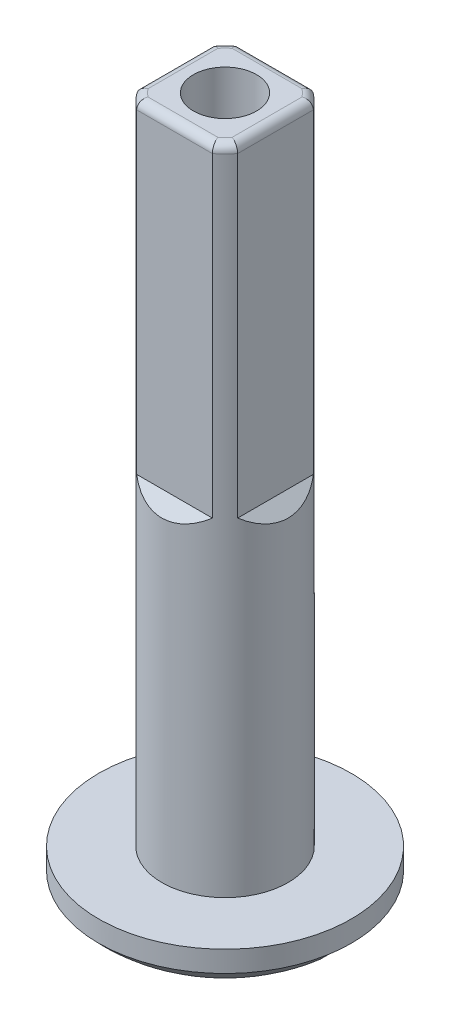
ISO-10303-21;
HEADER;
FILE_DESCRIPTION(('STEP AP214'),'2;1');
FILE_NAME('part.step','',(''),(''),'','','');
FILE_SCHEMA(('AUTOMOTIVE_DESIGN { 1 0 10303 214 1 1 1 1 }'));
ENDSEC;
DATA;
#1=APPLICATION_CONTEXT('core data for automotive mechanical design processes');
#2=APPLICATION_PROTOCOL_DEFINITION('international standard','automotive_design',2000,#1);
#3=PRODUCT_CONTEXT('',#1,'mechanical');
#4=PRODUCT('Part','Part','',(#3));
#5=PRODUCT_RELATED_PRODUCT_CATEGORY('part','',(#4));
#6=PRODUCT_DEFINITION_FORMATION('','',#4);
#7=PRODUCT_DEFINITION_CONTEXT('part definition',#1,'design');
#8=PRODUCT_DEFINITION('design','',#6,#7);
#9=PRODUCT_DEFINITION_SHAPE('','',#8);
#10=(LENGTH_UNIT() NAMED_UNIT(*) SI_UNIT(.MILLI.,.METRE.));
#11=(NAMED_UNIT(*) PLANE_ANGLE_UNIT() SI_UNIT($,.RADIAN.));
#12=(NAMED_UNIT(*) SI_UNIT($,.STERADIAN.) SOLID_ANGLE_UNIT());
#13=UNCERTAINTY_MEASURE_WITH_UNIT(LENGTH_MEASURE(1.E-05),#10,'distance_accuracy_value','');
#14=(GEOMETRIC_REPRESENTATION_CONTEXT(3) GLOBAL_UNCERTAINTY_ASSIGNED_CONTEXT((#13)) GLOBAL_UNIT_ASSIGNED_CONTEXT((#10,
#11,#12)) REPRESENTATION_CONTEXT('',''));
#15=CARTESIAN_POINT('',(0.,0.,0.));
#16=DIRECTION('',(0.,0.,1.));
#17=DIRECTION('',(1.,0.,0.));
#18=AXIS2_PLACEMENT_3D('',#15,#16,#17);
#19=CARTESIAN_POINT('',(0.,1.5,0.));
#20=DIRECTION('',(0.,1.,0.));
#21=DIRECTION('',(-1.,0.,0.));
#22=AXIS2_PLACEMENT_3D('',#19,#20,#21);
#23=DEGENERATE_TOROIDAL_SURFACE('',#22,0.76393202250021,3.,.T.);
#24=CARTESIAN_POINT('',(0.,-1.48836742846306,0.5));
#25=CARTESIAN_POINT('',(-0.0417178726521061,-1.48836596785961,0.5));
#26=CARTESIAN_POINT('',(-0.0834357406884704,-1.48884963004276,0.5));
#27=CARTESIAN_POINT('',(-0.166859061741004,-1.49052951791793,0.5));
#28=CARTESIAN_POINT('',(-0.208564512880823,-1.49172582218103,0.5));
#29=CARTESIAN_POINT('',(-0.292046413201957,-1.49427979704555,0.5));
#30=CARTESIAN_POINT('',(-0.333822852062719,-1.49563776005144,0.5));
#31=CARTESIAN_POINT('',(-0.41738765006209,-1.4979583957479,0.5));
#32=CARTESIAN_POINT('',(-0.459176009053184,-1.49892107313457,0.5));
#33=CARTESIAN_POINT('',(-0.543218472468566,-1.50003432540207,0.5));
#34=CARTESIAN_POINT('',(-0.585472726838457,-1.50017600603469,0.5));
#35=CARTESIAN_POINT('',(-0.669969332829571,-1.49932770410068,0.5));
#36=CARTESIAN_POINT('',(-0.712211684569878,-1.49833773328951,0.5));
#37=CARTESIAN_POINT('',(-0.838857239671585,-1.49335841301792,0.5));
#38=CARTESIAN_POINT('',(-0.923197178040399,-1.48736009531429,0.5));
#39=CARTESIAN_POINT('',(-1.09110987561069,-1.4691611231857,0.5));
#40=CARTESIAN_POINT('',(-1.17468345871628,-1.45696819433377,0.5));
#41=CARTESIAN_POINT('',(-1.34063863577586,-1.42606466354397,0.5));
#42=CARTESIAN_POINT('',(-1.42302001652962,-1.40735291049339,0.5));
#43=CARTESIAN_POINT('',(-1.58693692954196,-1.3630648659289,0.5));
#44=CARTESIAN_POINT('',(-1.66845209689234,-1.3374127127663,0.5));
#45=CARTESIAN_POINT('',(-1.82904193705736,-1.27942112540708,0.5));
#46=CARTESIAN_POINT('',(-1.90811668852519,-1.24708190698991,0.5));
#47=CARTESIAN_POINT('',(-2.14106155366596,-1.14010943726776,0.5));
#48=CARTESIAN_POINT('',(-2.29052810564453,-1.05555474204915,0.5));
#49=CARTESIAN_POINT('',(-2.57288769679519,-0.862269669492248,0.5));
#50=CARTESIAN_POINT('',(-2.7057750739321,-0.753531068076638,0.5));
#51=CARTESIAN_POINT('',(-2.95097113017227,-0.514999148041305,0.5));
#52=CARTESIAN_POINT('',(-3.06329181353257,-0.38521819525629,0.5));
#53=CARTESIAN_POINT('',(-3.26241005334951,-0.110608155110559,0.5));
#54=CARTESIAN_POINT('',(-3.34959358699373,0.0339413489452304,0.5));
#55=CARTESIAN_POINT('',(-3.49834140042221,0.335701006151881,0.5));
#56=CARTESIAN_POINT('',(-3.55990234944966,0.492912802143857,0.5));
#57=CARTESIAN_POINT('',(-3.65537250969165,0.814720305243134,0.5));
#58=CARTESIAN_POINT('',(-3.68940896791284,0.979278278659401,0.5));
#59=CARTESIAN_POINT('',(-3.72932856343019,1.31175830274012,0.5));
#60=CARTESIAN_POINT('',(-3.73521467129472,1.47967999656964,0.5));
#61=CARTESIAN_POINT('',(-3.7186832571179,1.81389034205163,0.5));
#62=CARTESIAN_POINT('',(-3.69630483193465,1.9801809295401,0.5));
#63=CARTESIAN_POINT('',(-3.6239456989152,2.30668016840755,0.5));
#64=CARTESIAN_POINT('',(-3.57395929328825,2.4668875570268,0.5));
#65=CARTESIAN_POINT('',(-3.44779306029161,2.77670089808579,0.5));
#66=CARTESIAN_POINT('',(-3.37160339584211,2.92630284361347,0.5));
#67=CARTESIAN_POINT('',(-3.19527696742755,3.21051772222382,0.5));
#68=CARTESIAN_POINT('',(-3.09515666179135,3.34514086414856,0.5));
#69=CARTESIAN_POINT('',(-2.87372326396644,3.59587147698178,0.5));
#70=CARTESIAN_POINT('',(-2.75238799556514,3.71195932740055,0.5));
#71=CARTESIAN_POINT('',(-2.49171068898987,3.92251451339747,0.5));
#72=CARTESIAN_POINT('',(-2.35233218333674,4.01693695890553,0.500000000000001));
#73=CARTESIAN_POINT('',(-2.13260818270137,4.14048430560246,0.500000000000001));
#74=CARTESIAN_POINT('',(-2.05726583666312,4.1787694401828,0.500000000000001));
#75=CARTESIAN_POINT('',(-1.90364346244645,4.24894354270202,0.500000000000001));
#76=CARTESIAN_POINT('',(-1.82536367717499,4.28083303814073,0.500000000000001));
#77=CARTESIAN_POINT('',(-1.66686431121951,4.33789991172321,0.500000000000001));
#78=CARTESIAN_POINT('',(-1.58665692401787,4.36311130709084,0.500000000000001));
#79=CARTESIAN_POINT('',(-1.42446049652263,4.406992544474,0.500000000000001));
#80=CARTESIAN_POINT('',(-1.34247123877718,4.42566158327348,0.500000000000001));
#81=CARTESIAN_POINT('',(-1.19445518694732,4.45333389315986,0.500000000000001));
#82=CARTESIAN_POINT('',(-1.12864903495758,4.46353927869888,0.500000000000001));
#83=CARTESIAN_POINT('',(-0.996588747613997,4.48004071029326,0.500000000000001));
#84=CARTESIAN_POINT('',(-0.930334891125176,4.48633899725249,0.500000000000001));
#85=CARTESIAN_POINT('',(-0.797256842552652,4.49535959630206,0.500000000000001));
#86=CARTESIAN_POINT('',(-0.730431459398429,4.49806370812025,0.500000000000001));
#87=CARTESIAN_POINT('',(-0.596714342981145,4.50044296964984,0.500000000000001));
#88=CARTESIAN_POINT('',(-0.529822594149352,4.50011696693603,0.500000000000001));
#89=CARTESIAN_POINT('',(-0.394176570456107,4.49757717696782,0.500000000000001));
#90=CARTESIAN_POINT('',(-0.325423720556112,4.49530968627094,0.500000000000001));
#91=CARTESIAN_POINT('',(-0.222298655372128,4.49214281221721,0.500000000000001));
#92=CARTESIAN_POINT('',(-0.187929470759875,4.49112638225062,0.500000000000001));
#93=CARTESIAN_POINT('',(-0.119181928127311,4.48950065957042,0.500000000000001));
#94=CARTESIAN_POINT('',(-0.084803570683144,4.48889134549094,0.500000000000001));
#95=CARTESIAN_POINT('',(-0.015999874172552,4.48828893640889,0.500000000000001));
#96=CARTESIAN_POINT('',(0.0184254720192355,4.48829657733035,0.500000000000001));
#97=CARTESIAN_POINT('',(0.0872715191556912,4.48892764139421,0.500000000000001));
#98=CARTESIAN_POINT('',(0.121692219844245,4.48955109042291,0.500000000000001));
#99=CARTESIAN_POINT('',(0.224969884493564,4.49202127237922,0.500000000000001));
#100=CARTESIAN_POINT('',(0.293809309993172,4.49446781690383,0.500000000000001));
#101=CARTESIAN_POINT('',(0.430985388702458,4.49838256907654,0.500000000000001));
#102=CARTESIAN_POINT('',(0.499321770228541,4.49985826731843,0.500000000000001));
#103=CARTESIAN_POINT('',(0.635992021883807,4.50012312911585,0.500000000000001));
#104=CARTESIAN_POINT('',(0.704325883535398,4.49891328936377,0.500000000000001));
#105=CARTESIAN_POINT('',(0.840660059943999,4.49294257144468,0.500000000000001));
#106=CARTESIAN_POINT('',(0.908660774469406,4.48819152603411,0.500000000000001));
#107=CARTESIAN_POINT('',(1.04427435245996,4.47470758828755,0.500000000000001));
#108=CARTESIAN_POINT('',(1.11188719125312,4.46597444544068,0.500000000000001));
#109=CARTESIAN_POINT('',(1.26408633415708,4.44146521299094,0.500000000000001));
#110=CARTESIAN_POINT('',(1.34847644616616,4.42444307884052,0.500000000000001));
#111=CARTESIAN_POINT('',(1.51571907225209,4.38351000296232,0.500000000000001));
#112=CARTESIAN_POINT('',(1.59856880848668,4.35958769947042,0.500000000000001));
#113=CARTESIAN_POINT('',(1.76204699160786,4.304864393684,0.500000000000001));
#114=CARTESIAN_POINT('',(1.84267350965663,4.27405761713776,0.500000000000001));
#115=CARTESIAN_POINT('',(2.00096910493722,4.20573851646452,0.500000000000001));
#116=CARTESIAN_POINT('',(2.07864013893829,4.16823072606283,0.500000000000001));
#117=CARTESIAN_POINT('',(2.23057245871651,4.08667257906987,0.500000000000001));
#118=CARTESIAN_POINT('',(2.30483042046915,4.04261601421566,0.5));
#119=CARTESIAN_POINT('',(2.44928876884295,3.94829335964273,0.5));
#120=CARTESIAN_POINT('',(2.5194881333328,3.89802571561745,0.5));
#121=CARTESIAN_POINT('',(2.72319830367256,3.73837725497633,0.5));
#122=CARTESIAN_POINT('',(2.84991867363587,3.62009854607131,0.5));
#123=CARTESIAN_POINT('',(3.07840915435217,3.36635923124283,0.5));
#124=CARTESIAN_POINT('',(3.18066907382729,3.23133646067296,0.5));
#125=CARTESIAN_POINT('',(3.36086948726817,2.94597096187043,0.5));
#126=CARTESIAN_POINT('',(3.43881899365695,2.79563393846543,0.5));
#127=CARTESIAN_POINT('',(3.56769988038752,2.48500332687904,0.5));
#128=CARTESIAN_POINT('',(3.61881137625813,2.32478439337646,0.5));
#129=CARTESIAN_POINT('',(3.6933581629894,1.99801193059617,0.5));
#130=CARTESIAN_POINT('',(3.7167907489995,1.83145778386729,0.5));
#131=CARTESIAN_POINT('',(3.73527313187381,1.49712595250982,0.5));
#132=CARTESIAN_POINT('',(3.7303809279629,1.32935147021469,0.5));
#133=CARTESIAN_POINT('',(3.69249070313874,0.997007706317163,0.5));
#134=CARTESIAN_POINT('',(3.65949285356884,0.832438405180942,0.5));
#135=CARTESIAN_POINT('',(3.56634775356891,0.511208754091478,0.5));
#136=CARTESIAN_POINT('',(3.50620607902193,0.354546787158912,0.5));
#137=CARTESIAN_POINT('',(3.3605123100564,0.0535485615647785,0.5));
#138=CARTESIAN_POINT('',(3.27496332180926,-0.090789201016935,0.5));
#139=CARTESIAN_POINT('',(3.08080199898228,-0.363235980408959,0.5));
#140=CARTESIAN_POINT('',(2.97216686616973,-0.491328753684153,0.5));
#141=CARTESIAN_POINT('',(2.73498593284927,-0.727584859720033,0.5));
#142=CARTESIAN_POINT('',(2.60643192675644,-0.835739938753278,0.5));
#143=CARTESIAN_POINT('',(2.3324437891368,-1.02957062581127,0.5));
#144=CARTESIAN_POINT('',(2.18693947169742,-1.11514760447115,0.5));
#145=CARTESIAN_POINT('',(1.95982213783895,-1.22446820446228,0.5));
#146=CARTESIAN_POINT('',(1.88264569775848,-1.25773247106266,0.5));
#147=CARTESIAN_POINT('',(1.72582773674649,-1.31780725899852,0.5));
#148=CARTESIAN_POINT('',(1.6461870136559,-1.34461984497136,0.5));
#149=CARTESIAN_POINT('',(1.48383754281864,-1.39204788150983,0.5));
#150=CARTESIAN_POINT('',(1.40110107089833,-1.41256799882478,0.5));
#151=CARTESIAN_POINT('',(1.23427797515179,-1.44692621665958,0.5));
#152=CARTESIAN_POINT('',(1.15019166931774,-1.46076586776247,0.5));
#153=CARTESIAN_POINT('',(0.981146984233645,-1.48204888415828,0.5));
#154=CARTESIAN_POINT('',(0.896187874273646,-1.48948635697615,0.5));
#155=CARTESIAN_POINT('',(0.725982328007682,-1.49860940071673,0.5));
#156=CARTESIAN_POINT('',(0.640735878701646,-1.50029470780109,0.5));
#157=CARTESIAN_POINT('',(0.509165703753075,-1.4997693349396,0.5));
#158=CARTESIAN_POINT('',(0.462822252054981,-1.49898498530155,0.5));
#159=CARTESIAN_POINT('',(0.370154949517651,-1.4967426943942,0.5));
#160=CARTESIAN_POINT('',(0.323831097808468,-1.49528478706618,0.5));
#161=CARTESIAN_POINT('',(0.231263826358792,-1.49240634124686,0.5));
#162=CARTESIAN_POINT('',(0.185020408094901,-1.49098574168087,0.5));
#163=CARTESIAN_POINT('',(0.0925179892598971,-1.48896715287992,0.5));
#164=CARTESIAN_POINT('',(0.0462589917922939,-1.48836904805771,0.5));
#165=CARTESIAN_POINT('',(0.,-1.48836742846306,0.5));
#166=B_SPLINE_CURVE_WITH_KNOTS('',3,(#24,#25,#26,#27,#28,#29,#30,#31,#32,#33,#34,#35,#36,#37,
#38,#39,#40,#41,#42,#43,#44,#45,#46,#47,#48,#49,#50,#51,#52,#53,#54,#55,#56,#57,#58,#59,#60,#61,
#62,#63,#64,#65,#66,#67,#68,#69,#70,#71,#72,#73,#74,#75,#76,#77,#78,#79,#80,#81,#82,#83,#84,#85,
#86,#87,#88,#89,#90,#91,#92,#93,#94,#95,#96,#97,#98,#99,#100,#101,#102,#103,#104,#105,#106,#107,
#108,#109,#110,#111,#112,#113,#114,#115,#116,#117,#118,#119,#120,#121,#122,#123,#124,#125,#126,
#127,#128,#129,#130,#131,#132,#133,#134,#135,#136,#137,#138,#139,#140,#141,#142,#143,#144,#145,
#146,#147,#148,#149,#150,#151,#152,#153,#154,#155,#156,#157,#158,#159,#160,#161,#162,#163,#164,
#165),.UNSPECIFIED.,.T.,.F.,(4,2,2,2,2,2,2,2,2,2,2,2,2,2,2,2,2,2,2,2,2,2,2,2,2,2,2,2,2,2,2,2,2,
2,2,2,2,2,2,2,2,2,2,2,2,2,2,2,2,2,2,2,2,2,2,2,2,2,2,2,2,2,2,2,2,2,2,2,2,2,4),(0.,
0.125152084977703,0.250317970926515,0.375713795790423,0.501108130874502,0.627858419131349,
0.75460739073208,1.00805070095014,1.2611787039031,1.51435142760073,1.77041180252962,
2.02646391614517,2.53894904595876,3.05160872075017,3.5639682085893,4.06798109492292,
4.5720594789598,5.0737939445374,5.57547546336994,6.07646379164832,6.57755555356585,
7.07883563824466,7.57977195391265,8.08123506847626,8.58372800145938,8.83702135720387,
9.09029381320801,9.34225018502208,9.59423747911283,9.79389972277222,9.9934473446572,
10.1940016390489,10.3946322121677,10.600998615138,10.7041509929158,10.807297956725,
10.9105679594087,11.0138423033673,11.2204902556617,11.4255245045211,11.6304826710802,
11.834873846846,12.0392778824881,12.2972581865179,12.5556657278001,12.8142908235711,
13.0727415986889,13.3314389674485,13.5902012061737,14.1073980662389,14.6131568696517,
15.1187279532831,15.6208612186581,16.1230435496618,16.6241979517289,17.1253492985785,
17.6263977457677,18.1273849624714,18.6288692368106,19.130560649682,19.6344086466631,
19.8862946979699,20.1381000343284,20.3935506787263,20.648942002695,20.9045681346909,
21.1602059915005,21.2992517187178,21.4382904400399,21.5770852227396,21.7158604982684),.UNSPECIFIED.);
#167=CARTESIAN_POINT('',(-0.577574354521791,-1.5,0.5));
#168=VERTEX_POINT('',#167);
#169=CARTESIAN_POINT('',(-2.95803989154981,-0.5,0.5));
#170=VERTEX_POINT('',#169);
#171=EDGE_CURVE('E520',#168,#170,#166,.T.);
#172=ORIENTED_EDGE('',*,*,#171,.F.);
#173=CARTESIAN_POINT('',(0.,-1.5,0.));
#174=DIRECTION('',(0.,1.,0.));
#175=DIRECTION('',(-1.,0.,0.));
#176=AXIS2_PLACEMENT_3D('',#173,#174,#175);
#177=CIRCLE('',#176,0.763932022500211);
#178=CARTESIAN_POINT('',(0.577574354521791,-1.5,0.5));
#179=VERTEX_POINT('',#178);
#180=EDGE_CURVE('E219',#168,#179,#177,.T.);
#181=ORIENTED_EDGE('',*,*,#180,.T.);
#182=CARTESIAN_POINT('',(2.95803989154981,-0.5,0.5));
#183=VERTEX_POINT('',#182);
#184=EDGE_CURVE('E526',#183,#179,#166,.T.);
#185=ORIENTED_EDGE('',*,*,#184,.F.);
#186=CARTESIAN_POINT('',(0.,-0.5,0.));
#187=DIRECTION('',(0.,1.,0.));
#188=DIRECTION('',(-1.,0.,0.));
#189=AXIS2_PLACEMENT_3D('',#186,#187,#188);
#190=CIRCLE('',#189,3.);
#191=EDGE_CURVE('E218',#170,#183,#190,.T.);
#192=ORIENTED_EDGE('',*,*,#191,.F.);
#193=EDGE_LOOP('',(#172,#181,#185,#192));
#194=FACE_BOUND('',#193,.T.);
#195=ADVANCED_FACE('F33',(#194),#23,.T.);
#196=CARTESIAN_POINT('',(0.,-1.5,0.));
#197=DIRECTION('',(0.,-1.,0.));
#198=DIRECTION('',(1.,0.,0.));
#199=AXIS2_PLACEMENT_3D('',#196,#197,#198);
#200=PLANE('',#199);
#201=DIRECTION('',(-1.,0.,0.));
#202=VECTOR('',#201,1.);
#203=CARTESIAN_POINT('',(0.,-1.5,0.5));
#204=LINE('',#203,#202);
#205=CARTESIAN_POINT('',(0.559016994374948,-1.5,0.5));
#206=VERTEX_POINT('',#205);
#207=EDGE_CURVE('E525',#179,#206,#204,.T.);
#208=ORIENTED_EDGE('',*,*,#207,.F.);
#209=ORIENTED_EDGE('',*,*,#180,.F.);
#210=CARTESIAN_POINT('',(-0.559016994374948,-1.5,0.5));
#211=VERTEX_POINT('',#210);
#212=EDGE_CURVE('E191',#211,#168,#204,.T.);
#213=ORIENTED_EDGE('',*,*,#212,.F.);
#214=CARTESIAN_POINT('',(0.,-1.5,0.));
#215=DIRECTION('',(0.,1.,0.));
#216=DIRECTION('',(0.,0.,1.));
#217=AXIS2_PLACEMENT_3D('',#214,#215,#216);
#218=CIRCLE('',#217,0.75);
#219=EDGE_CURVE('E527',#211,#206,#218,.T.);
#220=ORIENTED_EDGE('',*,*,#219,.T.);
#221=EDGE_LOOP('',(#208,#209,#213,#220));
#222=FACE_BOUND('',#221,.T.);
#223=ADVANCED_FACE('F390',(#222),#200,.T.);
#224=CARTESIAN_POINT('',(0.,15.5,0.));
#225=DIRECTION('',(0.,-1.,0.));
#226=DIRECTION('',(0.,0.,-1.));
#227=AXIS2_PLACEMENT_3D('',#224,#225,#226);
#228=CYLINDRICAL_SURFACE('',#227,1.5);
#229=CARTESIAN_POINT('',(0.,0.,0.));
#230=DIRECTION('',(0.,1.,0.));
#231=DIRECTION('',(-1.,0.,0.));
#232=AXIS2_PLACEMENT_3D('',#229,#230,#231);
#233=CIRCLE('',#232,1.5);
#234=CARTESIAN_POINT('',(-1.5,0.,0.));
#235=VERTEX_POINT('',#234);
#236=EDGE_CURVE('E228',#235,#235,#233,.T.);
#237=ORIENTED_EDGE('',*,*,#236,.T.);
#238=EDGE_LOOP('',(#237));
#239=FACE_BOUND('',#238,.T.);
#240=DIRECTION('',(0.,-1.,0.));
#241=VECTOR('',#240,1.);
#242=CARTESIAN_POINT('',(-0.9,15.5,1.2));
#243=LINE('',#242,#241);
#244=CARTESIAN_POINT('',(-0.9,15.3,1.2));
#245=VERTEX_POINT('',#244);
#246=CARTESIAN_POINT('',(-0.9,7.8,1.2));
#247=VERTEX_POINT('',#246);
#248=EDGE_CURVE('E427',#245,#247,#243,.T.);
#249=ORIENTED_EDGE('',*,*,#248,.F.);
#250=CARTESIAN_POINT('',(0.,15.3,0.));
#251=DIRECTION('',(0.,1.,0.));
#252=DIRECTION('',(0.,0.,1.));
#253=AXIS2_PLACEMENT_3D('',#250,#251,#252);
#254=CIRCLE('',#253,1.5);
#255=CARTESIAN_POINT('',(-1.2,15.3,0.9));
#256=VERTEX_POINT('',#255);
#257=EDGE_CURVE('E274',#245,#256,#254,.F.);
#258=ORIENTED_EDGE('',*,*,#257,.T.);
#259=DIRECTION('',(0.,-1.,0.));
#260=VECTOR('',#259,1.);
#261=CARTESIAN_POINT('',(-1.2,15.5,0.9));
#262=LINE('',#261,#260);
#263=CARTESIAN_POINT('',(-1.2,7.8,0.9));
#264=VERTEX_POINT('',#263);
#265=EDGE_CURVE('E450',#264,#256,#262,.F.);
#266=ORIENTED_EDGE('',*,*,#265,.F.);
#267=CARTESIAN_POINT('',(0.,9.00000000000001,0.));
#268=DIRECTION('',(-0.707106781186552,0.707106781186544,0.));
#269=DIRECTION('',(-0.707106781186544,-0.707106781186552,0.));
#270=AXIS2_PLACEMENT_3D('',#267,#268,#269);
#271=ELLIPSE('',#270,2.12132034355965,1.5);
#272=CARTESIAN_POINT('',(-1.5,7.5,0.));
#273=VERTEX_POINT('',#272);
#274=EDGE_CURVE('E462',#264,#273,#271,.F.);
#275=ORIENTED_EDGE('',*,*,#274,.T.);
#276=CARTESIAN_POINT('',(0.,9.00000000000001,0.));
#277=DIRECTION('',(-0.707106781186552,0.707106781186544,0.));
#278=DIRECTION('',(-0.707106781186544,-0.707106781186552,0.));
#279=AXIS2_PLACEMENT_3D('',#276,#277,#278);
#280=ELLIPSE('',#279,2.12132034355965,1.5);
#281=CARTESIAN_POINT('',(-1.2,7.8,-0.9));
#282=VERTEX_POINT('',#281);
#283=EDGE_CURVE('E461',#273,#282,#280,.F.);
#284=ORIENTED_EDGE('',*,*,#283,.T.);
#285=DIRECTION('',(0.,-1.,0.));
#286=VECTOR('',#285,1.);
#287=CARTESIAN_POINT('',(-1.2,15.5,-0.9));
#288=LINE('',#287,#286);
#289=CARTESIAN_POINT('',(-1.2,15.3,-0.9));
#290=VERTEX_POINT('',#289);
#291=EDGE_CURVE('E451',#290,#282,#288,.T.);
#292=ORIENTED_EDGE('',*,*,#291,.F.);
#293=CARTESIAN_POINT('',(0.,15.3,0.));
#294=DIRECTION('',(0.,1.,0.));
#295=DIRECTION('',(0.,0.,1.));
#296=AXIS2_PLACEMENT_3D('',#293,#294,#295);
#297=CIRCLE('',#296,1.5);
#298=CARTESIAN_POINT('',(-0.900000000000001,15.3,-1.2));
#299=VERTEX_POINT('',#298);
#300=EDGE_CURVE('E271',#290,#299,#297,.F.);
#301=ORIENTED_EDGE('',*,*,#300,.T.);
#302=DIRECTION('',(0.,-1.,0.));
#303=VECTOR('',#302,1.);
#304=CARTESIAN_POINT('',(-0.900000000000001,15.5,-1.2));
#305=LINE('',#304,#303);
#306=CARTESIAN_POINT('',(-0.900000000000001,7.8,-1.2));
#307=VERTEX_POINT('',#306);
#308=EDGE_CURVE('E445',#307,#299,#305,.F.);
#309=ORIENTED_EDGE('',*,*,#308,.F.);
#310=CARTESIAN_POINT('',(0.,9.00000000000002,0.));
#311=DIRECTION('',(0.,0.707106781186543,-0.707106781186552));
#312=DIRECTION('',(0.,-0.707106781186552,-0.707106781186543));
#313=AXIS2_PLACEMENT_3D('',#310,#311,#312);
#314=ELLIPSE('',#313,2.12132034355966,1.5);
#315=CARTESIAN_POINT('',(0.,7.5,-1.5));
#316=VERTEX_POINT('',#315);
#317=EDGE_CURVE('E471',#307,#316,#314,.F.);
#318=ORIENTED_EDGE('',*,*,#317,.T.);
#319=CARTESIAN_POINT('',(0.,9.00000000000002,0.));
#320=DIRECTION('',(0.,0.707106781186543,-0.707106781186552));
#321=DIRECTION('',(0.,-0.707106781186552,-0.707106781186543));
#322=AXIS2_PLACEMENT_3D('',#319,#320,#321);
#323=ELLIPSE('',#322,2.12132034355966,1.5);
#324=CARTESIAN_POINT('',(0.900000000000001,7.8,-1.2));
#325=VERTEX_POINT('',#324);
#326=EDGE_CURVE('E473',#316,#325,#323,.F.);
#327=ORIENTED_EDGE('',*,*,#326,.T.);
#328=DIRECTION('',(0.,-1.,0.));
#329=VECTOR('',#328,1.);
#330=CARTESIAN_POINT('',(0.900000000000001,15.5,-1.2));
#331=LINE('',#330,#329);
#332=CARTESIAN_POINT('',(0.900000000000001,15.3,-1.2));
#333=VERTEX_POINT('',#332);
#334=EDGE_CURVE('E447',#333,#325,#331,.T.);
#335=ORIENTED_EDGE('',*,*,#334,.F.);
#336=CARTESIAN_POINT('',(0.,15.3,0.));
#337=DIRECTION('',(0.,1.,0.));
#338=DIRECTION('',(0.,0.,1.));
#339=AXIS2_PLACEMENT_3D('',#336,#337,#338);
#340=CIRCLE('',#339,1.5);
#341=CARTESIAN_POINT('',(1.2,15.3,-0.9));
#342=VERTEX_POINT('',#341);
#343=EDGE_CURVE('E268',#333,#342,#340,.F.);
#344=ORIENTED_EDGE('',*,*,#343,.T.);
#345=DIRECTION('',(0.,-1.,0.));
#346=VECTOR('',#345,1.);
#347=CARTESIAN_POINT('',(1.2,15.5,-0.9));
#348=LINE('',#347,#346);
#349=CARTESIAN_POINT('',(1.2,7.8,-0.9));
#350=VERTEX_POINT('',#349);
#351=EDGE_CURVE('E434',#350,#342,#348,.F.);
#352=ORIENTED_EDGE('',*,*,#351,.F.);
#353=CARTESIAN_POINT('',(0.,9.00000000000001,0.));
#354=DIRECTION('',(0.707106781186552,0.707106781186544,0.));
#355=DIRECTION('',(0.707106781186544,-0.707106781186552,0.));
#356=AXIS2_PLACEMENT_3D('',#353,#354,#355);
#357=ELLIPSE('',#356,2.12132034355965,1.5);
#358=CARTESIAN_POINT('',(1.5,7.5,0.));
#359=VERTEX_POINT('',#358);
#360=EDGE_CURVE('E41',#350,#359,#357,.F.);
#361=ORIENTED_EDGE('',*,*,#360,.T.);
#362=CARTESIAN_POINT('',(0.,9.00000000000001,0.));
#363=DIRECTION('',(0.707106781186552,0.707106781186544,0.));
#364=DIRECTION('',(0.707106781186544,-0.707106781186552,0.));
#365=AXIS2_PLACEMENT_3D('',#362,#363,#364);
#366=ELLIPSE('',#365,2.12132034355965,1.5);
#367=CARTESIAN_POINT('',(1.2,7.8,0.9));
#368=VERTEX_POINT('',#367);
#369=EDGE_CURVE('E12',#359,#368,#366,.F.);
#370=ORIENTED_EDGE('',*,*,#369,.T.);
#371=DIRECTION('',(0.,-1.,0.));
#372=VECTOR('',#371,1.);
#373=CARTESIAN_POINT('',(1.2,15.5,0.9));
#374=LINE('',#373,#372);
#375=CARTESIAN_POINT('',(1.2,15.3,0.9));
#376=VERTEX_POINT('',#375);
#377=EDGE_CURVE('E437',#376,#368,#374,.T.);
#378=ORIENTED_EDGE('',*,*,#377,.F.);
#379=CARTESIAN_POINT('',(0.,15.3,0.));
#380=DIRECTION('',(0.,1.,0.));
#381=DIRECTION('',(0.,0.,1.));
#382=AXIS2_PLACEMENT_3D('',#379,#380,#381);
#383=CIRCLE('',#382,1.5);
#384=CARTESIAN_POINT('',(0.9,15.3,1.2));
#385=VERTEX_POINT('',#384);
#386=EDGE_CURVE('E265',#376,#385,#383,.F.);
#387=ORIENTED_EDGE('',*,*,#386,.T.);
#388=DIRECTION('',(0.,-1.,0.));
#389=VECTOR('',#388,1.);
#390=CARTESIAN_POINT('',(0.9,15.5,1.2));
#391=LINE('',#390,#389);
#392=CARTESIAN_POINT('',(0.9,7.8,1.2));
#393=VERTEX_POINT('',#392);
#394=EDGE_CURVE('E435',#393,#385,#391,.F.);
#395=ORIENTED_EDGE('',*,*,#394,.F.);
#396=CARTESIAN_POINT('',(0.,9.00000000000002,0.));
#397=DIRECTION('',(0.,0.707106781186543,0.707106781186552));
#398=DIRECTION('',(0.,-0.707106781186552,0.707106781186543));
#399=AXIS2_PLACEMENT_3D('',#396,#397,#398);
#400=ELLIPSE('',#399,2.12132034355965,1.5);
#401=CARTESIAN_POINT('',(0.,7.5,1.5));
#402=VERTEX_POINT('',#401);
#403=EDGE_CURVE('E53',#393,#402,#400,.F.);
#404=ORIENTED_EDGE('',*,*,#403,.T.);
#405=CARTESIAN_POINT('',(0.,9.00000000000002,0.));
#406=DIRECTION('',(0.,0.707106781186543,0.707106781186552));
#407=DIRECTION('',(0.,-0.707106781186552,0.707106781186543));
#408=AXIS2_PLACEMENT_3D('',#405,#406,#407);
#409=ELLIPSE('',#408,2.12132034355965,1.5);
#410=EDGE_CURVE('E431',#402,#247,#409,.F.);
#411=ORIENTED_EDGE('',*,*,#410,.T.);
#412=EDGE_LOOP('',(#249,#258,#266,#275,#284,#292,#301,#309,#318,#327,#335,#344,#352,#361,#370,
#378,#387,#395,#404,#411));
#413=FACE_BOUND('',#412,.T.);
#414=ADVANCED_FACE('F396',(#239,#413),#228,.T.);
#415=CARTESIAN_POINT('',(0.,15.5,0.));
#416=DIRECTION('',(0.,1.,0.));
#417=DIRECTION('',(0.,0.,1.));
#418=AXIS2_PLACEMENT_3D('',#415,#416,#417);
#419=PLANE('',#418);
#420=CARTESIAN_POINT('',(0.,15.5,0.));
#421=DIRECTION('',(0.,1.,0.));
#422=DIRECTION('',(0.,0.,1.));
#423=AXIS2_PLACEMENT_3D('',#420,#421,#422);
#424=CIRCLE('',#423,1.3);
#425=CARTESIAN_POINT('',(-1.,15.5,0.830662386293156));
#426=VERTEX_POINT('',#425);
#427=CARTESIAN_POINT('',(-0.830662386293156,15.5,0.99999999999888));
#428=VERTEX_POINT('',#427);
#429=EDGE_CURVE('E257',#426,#428,#424,.T.);
#430=ORIENTED_EDGE('',*,*,#429,.T.);
#431=DIRECTION('',(1.,0.,0.));
#432=VECTOR('',#431,1.);
#433=CARTESIAN_POINT('',(0.,15.5,1.));
#434=LINE('',#433,#432);
#435=CARTESIAN_POINT('',(0.830662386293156,15.5,0.99999999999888));
#436=VERTEX_POINT('',#435);
#437=EDGE_CURVE('E259',#428,#436,#434,.T.);
#438=ORIENTED_EDGE('',*,*,#437,.T.);
#439=CARTESIAN_POINT('',(0.,15.5,0.));
#440=DIRECTION('',(0.,1.,0.));
#441=DIRECTION('',(0.,0.,1.));
#442=AXIS2_PLACEMENT_3D('',#439,#440,#441);
#443=CIRCLE('',#442,1.3);
#444=CARTESIAN_POINT('',(0.99999999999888,15.5,0.830662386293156));
#445=VERTEX_POINT('',#444);
#446=EDGE_CURVE('E245',#436,#445,#443,.T.);
#447=ORIENTED_EDGE('',*,*,#446,.T.);
#448=DIRECTION('',(0.,0.,-1.));
#449=VECTOR('',#448,1.);
#450=CARTESIAN_POINT('',(1.,15.5,0.));
#451=LINE('',#450,#449);
#452=CARTESIAN_POINT('',(1.,15.5,-0.830662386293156));
#453=VERTEX_POINT('',#452);
#454=EDGE_CURVE('E247',#445,#453,#451,.T.);
#455=ORIENTED_EDGE('',*,*,#454,.T.);
#456=CARTESIAN_POINT('',(0.,15.5,0.));
#457=DIRECTION('',(0.,1.,0.));
#458=DIRECTION('',(0.,0.,1.));
#459=AXIS2_PLACEMENT_3D('',#456,#457,#458);
#460=CIRCLE('',#459,1.3);
#461=CARTESIAN_POINT('',(0.830662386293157,15.5,-0.99999999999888));
#462=VERTEX_POINT('',#461);
#463=EDGE_CURVE('E249',#453,#462,#460,.T.);
#464=ORIENTED_EDGE('',*,*,#463,.T.);
#465=DIRECTION('',(-1.,0.,0.));
#466=VECTOR('',#465,1.);
#467=CARTESIAN_POINT('',(0.,15.5,-1.));
#468=LINE('',#467,#466);
#469=CARTESIAN_POINT('',(-0.830662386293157,15.5,-0.999999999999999));
#470=VERTEX_POINT('',#469);
#471=EDGE_CURVE('E251',#462,#470,#468,.T.);
#472=ORIENTED_EDGE('',*,*,#471,.T.);
#473=CARTESIAN_POINT('',(0.,15.5,0.));
#474=DIRECTION('',(0.,1.,0.));
#475=DIRECTION('',(0.,0.,1.));
#476=AXIS2_PLACEMENT_3D('',#473,#474,#475);
#477=CIRCLE('',#476,1.3);
#478=CARTESIAN_POINT('',(-0.99999999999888,15.5,-0.830662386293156));
#479=VERTEX_POINT('',#478);
#480=EDGE_CURVE('E253',#470,#479,#477,.T.);
#481=ORIENTED_EDGE('',*,*,#480,.T.);
#482=DIRECTION('',(0.,0.,1.));
#483=VECTOR('',#482,1.);
#484=CARTESIAN_POINT('',(-1.,15.5,0.));
#485=LINE('',#484,#483);
#486=EDGE_CURVE('E255',#479,#426,#485,.T.);
#487=ORIENTED_EDGE('',*,*,#486,.T.);
#488=EDGE_LOOP('',(#430,#438,#447,#455,#464,#472,#481,#487));
#489=FACE_BOUND('',#488,.T.);
#490=CARTESIAN_POINT('',(0.,15.5,0.));
#491=DIRECTION('',(0.,1.,0.));
#492=DIRECTION('',(0.,0.,1.));
#493=AXIS2_PLACEMENT_3D('',#490,#491,#492);
#494=CIRCLE('',#493,0.75);
#495=CARTESIAN_POINT('',(0.,15.5,0.75));
#496=VERTEX_POINT('',#495);
#497=EDGE_CURVE('E529',#496,#496,#494,.T.);
#498=ORIENTED_EDGE('',*,*,#497,.F.);
#499=EDGE_LOOP('',(#498));
#500=FACE_BOUND('',#499,.T.);
#501=ADVANCED_FACE('F414',(#489,#500),#419,.T.);
#502=CARTESIAN_POINT('',(0.,0.,0.));
#503=DIRECTION('',(0.,1.,0.));
#504=DIRECTION('',(-1.,0.,0.));
#505=AXIS2_PLACEMENT_3D('',#502,#503,#504);
#506=PLANE('',#505);
#507=CARTESIAN_POINT('',(0.,0.,0.));
#508=DIRECTION('',(0.,1.,0.));
#509=DIRECTION('',(-1.,0.,0.));
#510=AXIS2_PLACEMENT_3D('',#507,#508,#509);
#511=CIRCLE('',#510,3.);
#512=CARTESIAN_POINT('',(-3.,0.,0.));
#513=VERTEX_POINT('',#512);
#514=EDGE_CURVE('E221',#513,#513,#511,.T.);
#515=ORIENTED_EDGE('',*,*,#514,.T.);
#516=EDGE_LOOP('',(#515));
#517=FACE_BOUND('',#516,.T.);
#518=ORIENTED_EDGE('',*,*,#236,.F.);
#519=EDGE_LOOP('',(#518));
#520=FACE_BOUND('',#519,.T.);
#521=ADVANCED_FACE('F410',(#517,#520),#506,.T.);
#522=CARTESIAN_POINT('',(0.,0.,0.));
#523=DIRECTION('',(0.,1.,0.));
#524=DIRECTION('',(-1.,0.,0.));
#525=AXIS2_PLACEMENT_3D('',#522,#523,#524);
#526=CYLINDRICAL_SURFACE('',#525,3.);
#527=ORIENTED_EDGE('',*,*,#191,.T.);
#528=CARTESIAN_POINT('',(0.,-0.5,0.));
#529=DIRECTION('',(0.,1.,0.));
#530=DIRECTION('',(0.,0.,1.));
#531=AXIS2_PLACEMENT_3D('',#528,#529,#530);
#532=CIRCLE('',#531,3.);
#533=CARTESIAN_POINT('',(2.95803989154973,-0.5,-0.5));
#534=VERTEX_POINT('',#533);
#535=EDGE_CURVE('E192',#534,#183,#532,.F.);
#536=ORIENTED_EDGE('',*,*,#535,.F.);
#537=CARTESIAN_POINT('',(-2.95803989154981,-0.5,-0.5));
#538=VERTEX_POINT('',#537);
#539=EDGE_CURVE('E209',#534,#538,#190,.T.);
#540=ORIENTED_EDGE('',*,*,#539,.T.);
#541=EDGE_CURVE('E180',#170,#538,#532,.F.);
#542=ORIENTED_EDGE('',*,*,#541,.F.);
#543=EDGE_LOOP('',(#527,#536,#540,#542));
#544=FACE_BOUND('',#543,.T.);
#545=ORIENTED_EDGE('',*,*,#514,.F.);
#546=EDGE_LOOP('',(#545));
#547=FACE_BOUND('',#546,.T.);
#548=ADVANCED_FACE('F216',(#544,#547),#526,.T.);
#549=CARTESIAN_POINT('',(0.,-1.48836742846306,-0.5));
#550=CARTESIAN_POINT('',(0.0417178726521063,-1.48836596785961,-0.5));
#551=CARTESIAN_POINT('',(0.0834357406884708,-1.48884963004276,-0.5));
#552=CARTESIAN_POINT('',(0.166859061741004,-1.49052951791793,-0.5));
#553=CARTESIAN_POINT('',(0.208564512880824,-1.49172582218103,-0.5));
#554=CARTESIAN_POINT('',(0.292046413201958,-1.49427979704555,-0.5));
#555=CARTESIAN_POINT('',(0.333822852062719,-1.49563776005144,-0.5));
#556=CARTESIAN_POINT('',(0.417387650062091,-1.4979583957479,-0.5));
#557=CARTESIAN_POINT('',(0.459176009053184,-1.49892107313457,-0.5));
#558=CARTESIAN_POINT('',(0.543218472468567,-1.50003432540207,-0.5));
#559=CARTESIAN_POINT('',(0.585472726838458,-1.50017600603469,-0.5));
#560=CARTESIAN_POINT('',(0.669969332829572,-1.49932770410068,-0.5));
#561=CARTESIAN_POINT('',(0.712211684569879,-1.49833773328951,-0.5));
#562=CARTESIAN_POINT('',(0.838857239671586,-1.49335841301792,-0.5));
#563=CARTESIAN_POINT('',(0.9231971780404,-1.48736009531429,-0.5));
#564=CARTESIAN_POINT('',(1.0911098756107,-1.4691611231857,-0.5));
#565=CARTESIAN_POINT('',(1.17468345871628,-1.45696819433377,-0.5));
#566=CARTESIAN_POINT('',(1.34063863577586,-1.42606466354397,-0.5));
#567=CARTESIAN_POINT('',(1.42302001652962,-1.40735291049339,-0.5));
#568=CARTESIAN_POINT('',(1.58693692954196,-1.3630648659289,-0.5));
#569=CARTESIAN_POINT('',(1.66845209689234,-1.3374127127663,-0.5));
#570=CARTESIAN_POINT('',(1.82904193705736,-1.27942112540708,-0.5));
#571=CARTESIAN_POINT('',(1.90811668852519,-1.2470819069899,-0.5));
#572=CARTESIAN_POINT('',(2.14106155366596,-1.14010943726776,-0.5));
#573=CARTESIAN_POINT('',(2.29052810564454,-1.05555474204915,-0.5));
#574=CARTESIAN_POINT('',(2.5728876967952,-0.862269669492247,-0.5));
#575=CARTESIAN_POINT('',(2.7057750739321,-0.753531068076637,-0.5));
#576=CARTESIAN_POINT('',(2.95097113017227,-0.514999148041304,-0.5));
#577=CARTESIAN_POINT('',(3.06329181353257,-0.385218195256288,-0.5));
#578=CARTESIAN_POINT('',(3.26241005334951,-0.110608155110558,-0.5));
#579=CARTESIAN_POINT('',(3.34959358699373,0.0339413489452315,-0.5));
#580=CARTESIAN_POINT('',(3.49834140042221,0.335701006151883,-0.5));
#581=CARTESIAN_POINT('',(3.55990234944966,0.492912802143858,-0.5));
#582=CARTESIAN_POINT('',(3.65537250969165,0.814720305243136,-0.5));
#583=CARTESIAN_POINT('',(3.68940896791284,0.979278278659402,-0.5));
#584=CARTESIAN_POINT('',(3.72932856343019,1.31175830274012,-0.5));
#585=CARTESIAN_POINT('',(3.73521467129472,1.47967999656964,-0.5));
#586=CARTESIAN_POINT('',(3.7186832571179,1.81389034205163,-0.5));
#587=CARTESIAN_POINT('',(3.69630483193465,1.9801809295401,-0.5));
#588=CARTESIAN_POINT('',(3.6239456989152,2.30668016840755,-0.5));
#589=CARTESIAN_POINT('',(3.57395929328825,2.4668875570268,-0.499999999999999));
#590=CARTESIAN_POINT('',(3.44779306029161,2.77670089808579,-0.499999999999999));
#591=CARTESIAN_POINT('',(3.37160339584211,2.92630284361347,-0.499999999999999));
#592=CARTESIAN_POINT('',(3.19527696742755,3.21051772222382,-0.499999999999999));
#593=CARTESIAN_POINT('',(3.09515666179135,3.34514086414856,-0.499999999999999));
#594=CARTESIAN_POINT('',(2.87372326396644,3.59587147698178,-0.499999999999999));
#595=CARTESIAN_POINT('',(2.75238799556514,3.71195932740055,-0.499999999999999));
#596=CARTESIAN_POINT('',(2.49171068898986,3.92251451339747,-0.499999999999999));
#597=CARTESIAN_POINT('',(2.35233218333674,4.01693695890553,-0.499999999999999));
#598=CARTESIAN_POINT('',(2.13260818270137,4.14048430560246,-0.499999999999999));
#599=CARTESIAN_POINT('',(2.05726583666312,4.1787694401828,-0.499999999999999));
#600=CARTESIAN_POINT('',(1.90364346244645,4.24894354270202,-0.499999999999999));
#601=CARTESIAN_POINT('',(1.82536367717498,4.28083303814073,-0.499999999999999));
#602=CARTESIAN_POINT('',(1.66686431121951,4.33789991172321,-0.499999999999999));
#603=CARTESIAN_POINT('',(1.58665692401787,4.36311130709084,-0.499999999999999));
#604=CARTESIAN_POINT('',(1.42446049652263,4.406992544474,-0.499999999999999));
#605=CARTESIAN_POINT('',(1.34247123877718,4.42566158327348,-0.499999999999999));
#606=CARTESIAN_POINT('',(1.19445518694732,4.45333389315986,-0.499999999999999));
#607=CARTESIAN_POINT('',(1.12864903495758,4.46353927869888,-0.499999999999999));
#608=CARTESIAN_POINT('',(0.996588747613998,4.48004071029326,-0.499999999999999));
#609=CARTESIAN_POINT('',(0.930334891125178,4.48633899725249,-0.499999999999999));
#610=CARTESIAN_POINT('',(0.797256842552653,4.49535959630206,-0.499999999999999));
#611=CARTESIAN_POINT('',(0.730431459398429,4.49806370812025,-0.499999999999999));
#612=CARTESIAN_POINT('',(0.596714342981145,4.50044296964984,-0.499999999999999));
#613=CARTESIAN_POINT('',(0.529822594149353,4.50011696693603,-0.499999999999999));
#614=CARTESIAN_POINT('',(0.394176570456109,4.49757717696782,-0.499999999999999));
#615=CARTESIAN_POINT('',(0.325423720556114,4.49530968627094,-0.499999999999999));
#616=CARTESIAN_POINT('',(0.22229865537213,4.49214281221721,-0.499999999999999));
#617=CARTESIAN_POINT('',(0.187929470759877,4.49112638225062,-0.499999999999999));
#618=CARTESIAN_POINT('',(0.119181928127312,4.48950065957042,-0.499999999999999));
#619=CARTESIAN_POINT('',(0.0848035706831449,4.48889134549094,-0.499999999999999));
#620=CARTESIAN_POINT('',(0.0159998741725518,4.48828893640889,-0.499999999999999));
#621=CARTESIAN_POINT('',(-0.0184254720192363,4.48829657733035,-0.499999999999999));
#622=CARTESIAN_POINT('',(-0.0872715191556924,4.48892764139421,-0.499999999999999));
#623=CARTESIAN_POINT('',(-0.121692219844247,4.48955109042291,-0.499999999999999));
#624=CARTESIAN_POINT('',(-0.224969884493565,4.49202127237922,-0.499999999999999));
#625=CARTESIAN_POINT('',(-0.293809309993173,4.49446781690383,-0.499999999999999));
#626=CARTESIAN_POINT('',(-0.430985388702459,4.49838256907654,-0.499999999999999));
#627=CARTESIAN_POINT('',(-0.499321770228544,4.49985826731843,-0.499999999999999));
#628=CARTESIAN_POINT('',(-0.63599202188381,4.50012312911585,-0.499999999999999));
#629=CARTESIAN_POINT('',(-0.704325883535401,4.49891328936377,-0.499999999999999));
#630=CARTESIAN_POINT('',(-0.840660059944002,4.49294257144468,-0.499999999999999));
#631=CARTESIAN_POINT('',(-0.908660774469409,4.48819152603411,-0.499999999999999));
#632=CARTESIAN_POINT('',(-1.04427435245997,4.47470758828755,-0.499999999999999));
#633=CARTESIAN_POINT('',(-1.11188719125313,4.46597444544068,-0.499999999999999));
#634=CARTESIAN_POINT('',(-1.26408633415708,4.44146521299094,-0.499999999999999));
#635=CARTESIAN_POINT('',(-1.34847644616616,4.42444307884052,-0.499999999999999));
#636=CARTESIAN_POINT('',(-1.51571907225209,4.38351000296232,-0.499999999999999));
#637=CARTESIAN_POINT('',(-1.59856880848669,4.35958769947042,-0.499999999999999));
#638=CARTESIAN_POINT('',(-1.76204699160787,4.304864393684,-0.499999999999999));
#639=CARTESIAN_POINT('',(-1.84267350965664,4.27405761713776,-0.499999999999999));
#640=CARTESIAN_POINT('',(-2.00096910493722,4.20573851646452,-0.499999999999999));
#641=CARTESIAN_POINT('',(-2.07864013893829,4.16823072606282,-0.499999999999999));
#642=CARTESIAN_POINT('',(-2.23057245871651,4.08667257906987,-0.499999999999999));
#643=CARTESIAN_POINT('',(-2.30483042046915,4.04261601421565,-0.499999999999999));
#644=CARTESIAN_POINT('',(-2.44928876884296,3.94829335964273,-0.499999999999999));
#645=CARTESIAN_POINT('',(-2.51948813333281,3.89802571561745,-0.499999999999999));
#646=CARTESIAN_POINT('',(-2.72319830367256,3.73837725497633,-0.499999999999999));
#647=CARTESIAN_POINT('',(-2.84991867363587,3.62009854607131,-0.499999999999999));
#648=CARTESIAN_POINT('',(-3.07840915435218,3.36635923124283,-0.499999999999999));
#649=CARTESIAN_POINT('',(-3.18066907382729,3.23133646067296,-0.499999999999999));
#650=CARTESIAN_POINT('',(-3.36086948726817,2.94597096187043,-0.499999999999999));
#651=CARTESIAN_POINT('',(-3.43881899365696,2.79563393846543,-0.499999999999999));
#652=CARTESIAN_POINT('',(-3.56769988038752,2.48500332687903,-0.499999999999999));
#653=CARTESIAN_POINT('',(-3.61881137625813,2.32478439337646,-0.5));
#654=CARTESIAN_POINT('',(-3.6933581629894,1.99801193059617,-0.5));
#655=CARTESIAN_POINT('',(-3.7167907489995,1.83145778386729,-0.5));
#656=CARTESIAN_POINT('',(-3.73527313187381,1.49712595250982,-0.5));
#657=CARTESIAN_POINT('',(-3.7303809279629,1.32935147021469,-0.5));
#658=CARTESIAN_POINT('',(-3.69249070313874,0.997007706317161,-0.5));
#659=CARTESIAN_POINT('',(-3.65949285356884,0.832438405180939,-0.5));
#660=CARTESIAN_POINT('',(-3.56634775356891,0.511208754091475,-0.5));
#661=CARTESIAN_POINT('',(-3.50620607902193,0.35454678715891,-0.5));
#662=CARTESIAN_POINT('',(-3.3605123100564,0.0535485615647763,-0.5));
#663=CARTESIAN_POINT('',(-3.27496332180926,-0.090789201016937,-0.5));
#664=CARTESIAN_POINT('',(-3.08080199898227,-0.363235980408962,-0.5));
#665=CARTESIAN_POINT('',(-2.97216686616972,-0.491328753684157,-0.5));
#666=CARTESIAN_POINT('',(-2.73498593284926,-0.727584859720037,-0.5));
#667=CARTESIAN_POINT('',(-2.60643192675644,-0.835739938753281,-0.5));
#668=CARTESIAN_POINT('',(-2.3324437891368,-1.02957062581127,-0.5));
#669=CARTESIAN_POINT('',(-2.18693947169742,-1.11514760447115,-0.5));
#670=CARTESIAN_POINT('',(-1.95982213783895,-1.22446820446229,-0.5));
#671=CARTESIAN_POINT('',(-1.88264569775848,-1.25773247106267,-0.5));
#672=CARTESIAN_POINT('',(-1.72582773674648,-1.31780725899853,-0.5));
#673=CARTESIAN_POINT('',(-1.6461870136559,-1.34461984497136,-0.5));
#674=CARTESIAN_POINT('',(-1.48383754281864,-1.39204788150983,-0.5));
#675=CARTESIAN_POINT('',(-1.40110107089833,-1.41256799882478,-0.5));
#676=CARTESIAN_POINT('',(-1.23427797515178,-1.44692621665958,-0.5));
#677=CARTESIAN_POINT('',(-1.15019166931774,-1.46076586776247,-0.5));
#678=CARTESIAN_POINT('',(-0.981146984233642,-1.48204888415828,-0.5));
#679=CARTESIAN_POINT('',(-0.896187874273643,-1.48948635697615,-0.5));
#680=CARTESIAN_POINT('',(-0.725982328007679,-1.49860940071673,-0.5));
#681=CARTESIAN_POINT('',(-0.640735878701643,-1.50029470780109,-0.5));
#682=CARTESIAN_POINT('',(-0.509165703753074,-1.4997693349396,-0.5));
#683=CARTESIAN_POINT('',(-0.462822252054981,-1.49898498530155,-0.5));
#684=CARTESIAN_POINT('',(-0.370154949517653,-1.4967426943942,-0.5));
#685=CARTESIAN_POINT('',(-0.32383109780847,-1.49528478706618,-0.5));
#686=CARTESIAN_POINT('',(-0.231263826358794,-1.49240634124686,-0.5));
#687=CARTESIAN_POINT('',(-0.185020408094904,-1.49098574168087,-0.5));
#688=CARTESIAN_POINT('',(-0.0925179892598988,-1.48896715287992,-0.5));
#689=CARTESIAN_POINT('',(-0.0462589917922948,-1.48836904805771,-0.5));
#690=CARTESIAN_POINT('',(0.,-1.48836742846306,-0.5));
#691=B_SPLINE_CURVE_WITH_KNOTS('',3,(#549,#550,#551,#552,#553,#554,#555,#556,#557,#558,#559,
#560,#561,#562,#563,#564,#565,#566,#567,#568,#569,#570,#571,#572,#573,#574,#575,#576,#577,#578,
#579,#580,#581,#582,#583,#584,#585,#586,#587,#588,#589,#590,#591,#592,#593,#594,#595,#596,#597,
#598,#599,#600,#601,#602,#603,#604,#605,#606,#607,#608,#609,#610,#611,#612,#613,#614,#615,#616,
#617,#618,#619,#620,#621,#622,#623,#624,#625,#626,#627,#628,#629,#630,#631,#632,#633,#634,#635,
#636,#637,#638,#639,#640,#641,#642,#643,#644,#645,#646,#647,#648,#649,#650,#651,#652,#653,#654,
#655,#656,#657,#658,#659,#660,#661,#662,#663,#664,#665,#666,#667,#668,#669,#670,#671,#672,#673,
#674,#675,#676,#677,#678,#679,#680,#681,#682,#683,#684,#685,#686,#687,#688,#689,#690),
.UNSPECIFIED.,.T.,.F.,(4,2,2,2,2,2,2,2,2,2,2,2,2,2,2,2,2,2,2,2,2,2,2,2,2,2,2,2,2,2,2,2,2,2,2,2,
2,2,2,2,2,2,2,2,2,2,2,2,2,2,2,2,2,2,2,2,2,2,2,2,2,2,2,2,2,2,2,2,2,2,4),(0.,0.125152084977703,
0.250317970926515,0.375713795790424,0.501108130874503,0.62785841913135,0.754607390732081,
1.00805070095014,1.2611787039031,1.51435142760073,1.77041180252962,2.02646391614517,
2.53894904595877,3.05160872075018,3.5639682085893,4.06798109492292,4.5720594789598,
5.0737939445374,5.57547546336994,6.07646379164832,6.57755555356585,7.07883563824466,
7.57977195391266,8.08123506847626,8.58372800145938,8.83702135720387,9.09029381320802,
9.34225018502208,9.59423747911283,9.79389972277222,9.9934473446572,10.1940016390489,
10.3946322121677,10.600998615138,10.7041509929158,10.807297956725,10.9105679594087,
11.0138423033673,11.2204902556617,11.4255245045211,11.6304826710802,11.834873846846,
12.0392778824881,12.2972581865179,12.5556657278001,12.8142908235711,13.0727415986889,
13.3314389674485,13.5902012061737,14.107398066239,14.6131568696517,15.1187279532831,
15.6208612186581,16.1230435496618,16.6241979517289,17.1253492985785,17.6263977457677,
18.1273849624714,18.6288692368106,19.130560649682,19.6344086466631,19.8862946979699,
20.1381000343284,20.3935506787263,20.648942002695,20.9045681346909,21.1602059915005,
21.2992517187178,21.4382904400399,21.5770852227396,21.7158604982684),.UNSPECIFIED.);
#692=CARTESIAN_POINT('',(0.577574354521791,-1.5,-0.5));
#693=VERTEX_POINT('',#692);
#694=EDGE_CURVE('E215',#693,#534,#691,.T.);
#695=ORIENTED_EDGE('',*,*,#694,.F.);
#696=CARTESIAN_POINT('',(-0.57757435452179,-1.5,-0.5));
#697=VERTEX_POINT('',#696);
#698=EDGE_CURVE('E212',#693,#697,#177,.T.);
#699=ORIENTED_EDGE('',*,*,#698,.T.);
#700=EDGE_CURVE('E197',#538,#697,#691,.T.);
#701=ORIENTED_EDGE('',*,*,#700,.F.);
#702=ORIENTED_EDGE('',*,*,#539,.F.);
#703=EDGE_LOOP('',(#695,#699,#701,#702));
#704=FACE_BOUND('',#703,.T.);
#705=ADVANCED_FACE('F208',(#704),#23,.T.);
#706=DIRECTION('',(1.,0.,0.));
#707=VECTOR('',#706,1.);
#708=CARTESIAN_POINT('',(0.,-1.5,-0.5));
#709=LINE('',#708,#707);
#710=CARTESIAN_POINT('',(-0.559016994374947,-1.5,-0.5));
#711=VERTEX_POINT('',#710);
#712=EDGE_CURVE('E213',#697,#711,#709,.T.);
#713=ORIENTED_EDGE('',*,*,#712,.F.);
#714=ORIENTED_EDGE('',*,*,#698,.F.);
#715=CARTESIAN_POINT('',(0.559016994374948,-1.5,-0.5));
#716=VERTEX_POINT('',#715);
#717=EDGE_CURVE('E499',#716,#693,#709,.T.);
#718=ORIENTED_EDGE('',*,*,#717,.F.);
#719=EDGE_CURVE('E439',#716,#711,#218,.T.);
#720=ORIENTED_EDGE('',*,*,#719,.T.);
#721=EDGE_LOOP('',(#713,#714,#718,#720));
#722=FACE_BOUND('',#721,.T.);
#723=ADVANCED_FACE('F399',(#722),#200,.T.);
#724=CARTESIAN_POINT('',(1.2,7.5,1.2));
#725=DIRECTION('',(0.,0.,1.));
#726=DIRECTION('',(1.,0.,0.));
#727=AXIS2_PLACEMENT_3D('',#724,#725,#726);
#728=PLANE('',#727);
#729=ORIENTED_EDGE('',*,*,#248,.T.);
#730=DIRECTION('',(1.,0.,0.));
#731=VECTOR('',#730,1.);
#732=CARTESIAN_POINT('',(0.9,7.8,1.2));
#733=LINE('',#732,#731);
#734=EDGE_CURVE('E463',#247,#393,#733,.T.);
#735=ORIENTED_EDGE('',*,*,#734,.T.);
#736=ORIENTED_EDGE('',*,*,#394,.T.);
#737=DIRECTION('',(1.,0.,0.));
#738=VECTOR('',#737,1.);
#739=CARTESIAN_POINT('',(1.2,15.3,1.2));
#740=LINE('',#739,#738);
#741=EDGE_CURVE('E262',#385,#245,#740,.F.);
#742=ORIENTED_EDGE('',*,*,#741,.T.);
#743=EDGE_LOOP('',(#729,#735,#736,#742));
#744=FACE_BOUND('',#743,.T.);
#745=ADVANCED_FACE('F408',(#744),#728,.T.);
#746=CARTESIAN_POINT('',(1.2,7.5,1.2));
#747=DIRECTION('',(1.,0.,0.));
#748=DIRECTION('',(0.,0.,-1.));
#749=AXIS2_PLACEMENT_3D('',#746,#747,#748);
#750=PLANE('',#749);
#751=ORIENTED_EDGE('',*,*,#377,.T.);
#752=DIRECTION('',(0.,0.,-1.));
#753=VECTOR('',#752,1.);
#754=CARTESIAN_POINT('',(1.2,7.8,-0.9));
#755=LINE('',#754,#753);
#756=EDGE_CURVE('E465',#368,#350,#755,.T.);
#757=ORIENTED_EDGE('',*,*,#756,.T.);
#758=ORIENTED_EDGE('',*,*,#351,.T.);
#759=DIRECTION('',(0.,0.,-1.));
#760=VECTOR('',#759,1.);
#761=CARTESIAN_POINT('',(1.2,15.3,1.2));
#762=LINE('',#761,#760);
#763=EDGE_CURVE('E281',#342,#376,#762,.F.);
#764=ORIENTED_EDGE('',*,*,#763,.T.);
#765=EDGE_LOOP('',(#751,#757,#758,#764));
#766=FACE_BOUND('',#765,.T.);
#767=ADVANCED_FACE('F691',(#766),#750,.T.);
#768=CARTESIAN_POINT('',(1.2,7.5,-1.2));
#769=DIRECTION('',(0.,0.,-1.));
#770=DIRECTION('',(-1.,0.,0.));
#771=AXIS2_PLACEMENT_3D('',#768,#769,#770);
#772=PLANE('',#771);
#773=ORIENTED_EDGE('',*,*,#334,.T.);
#774=DIRECTION('',(-1.,0.,0.));
#775=VECTOR('',#774,1.);
#776=CARTESIAN_POINT('',(-0.900000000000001,7.8,-1.2));
#777=LINE('',#776,#775);
#778=EDGE_CURVE('E283',#325,#307,#777,.T.);
#779=ORIENTED_EDGE('',*,*,#778,.T.);
#780=ORIENTED_EDGE('',*,*,#308,.T.);
#781=DIRECTION('',(-1.,0.,0.));
#782=VECTOR('',#781,1.);
#783=CARTESIAN_POINT('',(1.2,15.3,-1.2));
#784=LINE('',#783,#782);
#785=EDGE_CURVE('E279',#299,#333,#784,.F.);
#786=ORIENTED_EDGE('',*,*,#785,.T.);
#787=EDGE_LOOP('',(#773,#779,#780,#786));
#788=FACE_BOUND('',#787,.T.);
#789=ADVANCED_FACE('F484',(#788),#772,.T.);
#790=CARTESIAN_POINT('',(-1.2,7.5,1.2));
#791=DIRECTION('',(-1.,0.,0.));
#792=DIRECTION('',(0.,0.,1.));
#793=AXIS2_PLACEMENT_3D('',#790,#791,#792);
#794=PLANE('',#793);
#795=ORIENTED_EDGE('',*,*,#291,.T.);
#796=DIRECTION('',(0.,0.,1.));
#797=VECTOR('',#796,1.);
#798=CARTESIAN_POINT('',(-1.2,7.8,0.9));
#799=LINE('',#798,#797);
#800=EDGE_CURVE('E458',#282,#264,#799,.T.);
#801=ORIENTED_EDGE('',*,*,#800,.T.);
#802=ORIENTED_EDGE('',*,*,#265,.T.);
#803=DIRECTION('',(0.,0.,1.));
#804=VECTOR('',#803,1.);
#805=CARTESIAN_POINT('',(-1.2,15.3,1.2));
#806=LINE('',#805,#804);
#807=EDGE_CURVE('E277',#256,#290,#806,.F.);
#808=ORIENTED_EDGE('',*,*,#807,.T.);
#809=EDGE_LOOP('',(#795,#801,#802,#808));
#810=FACE_BOUND('',#809,.T.);
#811=ADVANCED_FACE('F457',(#810),#794,.T.);
#812=CARTESIAN_POINT('',(0.,-1.5,0.));
#813=DIRECTION('',(0.,1.,0.));
#814=DIRECTION('',(0.,0.,1.));
#815=AXIS2_PLACEMENT_3D('',#812,#813,#814);
#816=CYLINDRICAL_SURFACE('',#815,0.75);
#817=ORIENTED_EDGE('',*,*,#219,.F.);
#818=DIRECTION('',(0.,1.,0.));
#819=VECTOR('',#818,1.);
#820=CARTESIAN_POINT('',(-0.559016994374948,-1.5,0.5));
#821=LINE('',#820,#819);
#822=CARTESIAN_POINT('',(-0.559016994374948,-0.5,0.5));
#823=VERTEX_POINT('',#822);
#824=EDGE_CURVE('E242',#211,#823,#821,.T.);
#825=ORIENTED_EDGE('',*,*,#824,.T.);
#826=CARTESIAN_POINT('',(0.,-0.5,0.));
#827=DIRECTION('',(0.,1.,0.));
#828=DIRECTION('',(0.,0.,1.));
#829=AXIS2_PLACEMENT_3D('',#826,#827,#828);
#830=CIRCLE('',#829,0.75);
#831=CARTESIAN_POINT('',(-0.559016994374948,-0.5,-0.5));
#832=VERTEX_POINT('',#831);
#833=EDGE_CURVE('E238',#823,#832,#830,.F.);
#834=ORIENTED_EDGE('',*,*,#833,.T.);
#835=DIRECTION('',(0.,1.,0.));
#836=VECTOR('',#835,1.);
#837=CARTESIAN_POINT('',(-0.559016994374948,-1.5,-0.5));
#838=LINE('',#837,#836);
#839=EDGE_CURVE('E200',#832,#711,#838,.F.);
#840=ORIENTED_EDGE('',*,*,#839,.T.);
#841=ORIENTED_EDGE('',*,*,#719,.F.);
#842=DIRECTION('',(0.,1.,0.));
#843=VECTOR('',#842,1.);
#844=CARTESIAN_POINT('',(0.559016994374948,-1.5,-0.5));
#845=LINE('',#844,#843);
#846=CARTESIAN_POINT('',(0.559016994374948,-0.5,-0.5));
#847=VERTEX_POINT('',#846);
#848=EDGE_CURVE('E231',#716,#847,#845,.T.);
#849=ORIENTED_EDGE('',*,*,#848,.T.);
#850=CARTESIAN_POINT('',(0.559016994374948,-0.5,0.5));
#851=VERTEX_POINT('',#850);
#852=EDGE_CURVE('E234',#847,#851,#830,.F.);
#853=ORIENTED_EDGE('',*,*,#852,.T.);
#854=DIRECTION('',(0.,1.,0.));
#855=VECTOR('',#854,1.);
#856=CARTESIAN_POINT('',(0.559016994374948,-1.5,0.5));
#857=LINE('',#856,#855);
#858=EDGE_CURVE('E237',#851,#206,#857,.F.);
#859=ORIENTED_EDGE('',*,*,#858,.T.);
#860=EDGE_LOOP('',(#817,#825,#834,#840,#841,#849,#853,#859));
#861=FACE_BOUND('',#860,.T.);
#862=ORIENTED_EDGE('',*,*,#497,.T.);
#863=EDGE_LOOP('',(#862));
#864=FACE_BOUND('',#863,.T.);
#865=ADVANCED_FACE('F511',(#861,#864),#816,.F.);
#866=CARTESIAN_POINT('',(-4.,-0.5,-0.5));
#867=DIRECTION('',(0.,0.,-1.));
#868=DIRECTION('',(0.,1.,0.));
#869=AXIS2_PLACEMENT_3D('',#866,#867,#868);
#870=PLANE('',#869);
#871=ORIENTED_EDGE('',*,*,#694,.T.);
#872=DIRECTION('',(1.,0.,0.));
#873=VECTOR('',#872,1.);
#874=CARTESIAN_POINT('',(-4.,-0.5,-0.5));
#875=LINE('',#874,#873);
#876=EDGE_CURVE('E202',#847,#534,#875,.T.);
#877=ORIENTED_EDGE('',*,*,#876,.F.);
#878=ORIENTED_EDGE('',*,*,#848,.F.);
#879=ORIENTED_EDGE('',*,*,#717,.T.);
#880=EDGE_LOOP('',(#871,#877,#878,#879));
#881=FACE_BOUND('',#880,.T.);
#882=ADVANCED_FACE('F505',(#881),#870,.F.);
#883=CARTESIAN_POINT('',(-4.,-0.5,0.5));
#884=DIRECTION('',(0.,1.,0.));
#885=DIRECTION('',(0.,0.,1.));
#886=AXIS2_PLACEMENT_3D('',#883,#884,#885);
#887=PLANE('',#886);
#888=ORIENTED_EDGE('',*,*,#535,.T.);
#889=DIRECTION('',(1.,0.,0.));
#890=VECTOR('',#889,1.);
#891=CARTESIAN_POINT('',(-4.,-0.5,0.5));
#892=LINE('',#891,#890);
#893=EDGE_CURVE('E201',#851,#183,#892,.T.);
#894=ORIENTED_EDGE('',*,*,#893,.F.);
#895=ORIENTED_EDGE('',*,*,#852,.F.);
#896=ORIENTED_EDGE('',*,*,#876,.T.);
#897=EDGE_LOOP('',(#888,#894,#895,#896));
#898=FACE_BOUND('',#897,.T.);
#899=ADVANCED_FACE('F510',(#898),#887,.F.);
#900=CARTESIAN_POINT('',(-4.,-0.5,0.5));
#901=DIRECTION('',(0.,0.,1.));
#902=DIRECTION('',(0.,-1.,0.));
#903=AXIS2_PLACEMENT_3D('',#900,#901,#902);
#904=PLANE('',#903);
#905=ORIENTED_EDGE('',*,*,#184,.T.);
#906=ORIENTED_EDGE('',*,*,#207,.T.);
#907=ORIENTED_EDGE('',*,*,#858,.F.);
#908=ORIENTED_EDGE('',*,*,#893,.T.);
#909=EDGE_LOOP('',(#905,#906,#907,#908));
#910=FACE_BOUND('',#909,.T.);
#911=ADVANCED_FACE('F517',(#910),#904,.F.);
#912=ORIENTED_EDGE('',*,*,#541,.T.);
#913=EDGE_CURVE('E183',#538,#832,#875,.T.);
#914=ORIENTED_EDGE('',*,*,#913,.T.);
#915=ORIENTED_EDGE('',*,*,#833,.F.);
#916=EDGE_CURVE('E186',#170,#823,#892,.T.);
#917=ORIENTED_EDGE('',*,*,#916,.F.);
#918=EDGE_LOOP('',(#912,#914,#915,#917));
#919=FACE_BOUND('',#918,.T.);
#920=ADVANCED_FACE('F182',(#919),#887,.F.);
#921=ORIENTED_EDGE('',*,*,#700,.T.);
#922=ORIENTED_EDGE('',*,*,#712,.T.);
#923=ORIENTED_EDGE('',*,*,#839,.F.);
#924=ORIENTED_EDGE('',*,*,#913,.F.);
#925=EDGE_LOOP('',(#921,#922,#923,#924));
#926=FACE_BOUND('',#925,.T.);
#927=ADVANCED_FACE('F196',(#926),#870,.F.);
#928=ORIENTED_EDGE('',*,*,#171,.T.);
#929=ORIENTED_EDGE('',*,*,#916,.T.);
#930=ORIENTED_EDGE('',*,*,#824,.F.);
#931=ORIENTED_EDGE('',*,*,#212,.T.);
#932=EDGE_LOOP('',(#928,#929,#930,#931));
#933=FACE_BOUND('',#932,.T.);
#934=ADVANCED_FACE('F371',(#933),#904,.F.);
#935=CARTESIAN_POINT('',(0.,15.3,-1.));
#936=DIRECTION('',(-1.,0.,0.));
#937=DIRECTION('',(0.,0.,1.));
#938=AXIS2_PLACEMENT_3D('',#935,#936,#937);
#939=CYLINDRICAL_SURFACE('',#938,0.2);
#940=CARTESIAN_POINT('',(0.900000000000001,15.3,-1.2));
#941=CARTESIAN_POINT('',(0.900003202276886,15.3108267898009,-1.20001130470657));
#942=CARTESIAN_POINT('',(0.899707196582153,15.3216475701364,-1.19912161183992));
#943=CARTESIAN_POINT('',(0.898541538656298,15.3429544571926,-1.19562714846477));
#944=CARTESIAN_POINT('',(0.897673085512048,15.3534412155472,-1.19302596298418));
#945=CARTESIAN_POINT('',(0.895387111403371,15.3738051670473,-1.18619476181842));
#946=CARTESIAN_POINT('',(0.893969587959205,15.3836823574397,-1.18196473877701));
#947=CARTESIAN_POINT('',(0.890628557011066,15.4025690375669,-1.17202737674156));
#948=CARTESIAN_POINT('',(0.888704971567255,15.4115783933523,-1.16631981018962));
#949=CARTESIAN_POINT('',(0.884360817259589,15.4286856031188,-1.1534820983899));
#950=CARTESIAN_POINT('',(0.881930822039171,15.4367608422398,-1.14632505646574));
#951=CARTESIAN_POINT('',(0.87666425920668,15.4516008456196,-1.13088882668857));
#952=CARTESIAN_POINT('',(0.873827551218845,15.4583651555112,-1.12260925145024));
#953=CARTESIAN_POINT('',(0.867671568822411,15.4707435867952,-1.10474005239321));
#954=CARTESIAN_POINT('',(0.864335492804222,15.4762854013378,-1.09510619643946));
#955=CARTESIAN_POINT('',(0.857378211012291,15.4856752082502,-1.07514220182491));
#956=CARTESIAN_POINT('',(0.853757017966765,15.4895232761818,-1.06481209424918));
#957=CARTESIAN_POINT('',(0.847100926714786,15.494841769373,-1.04595220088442));
#958=CARTESIAN_POINT('',(0.844102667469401,15.4966418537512,-1.03750008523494));
#959=CARTESIAN_POINT('',(0.838029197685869,15.4991347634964,-1.02047292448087));
#960=CARTESIAN_POINT('',(0.834954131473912,15.4998295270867,-1.0118981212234));
#961=CARTESIAN_POINT('',(0.831463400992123,15.4999907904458,-1.00221870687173));
#962=CARTESIAN_POINT('',(0.831062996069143,15.5000000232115,-1.00110923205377));
#963=CARTESIAN_POINT('',(0.830662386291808,15.5,-1.));
#964=B_SPLINE_CURVE_WITH_KNOTS('',3,(#940,#941,#942,#943,#944,#945,#946,#947,#948,#949,#950,
#951,#952,#953,#954,#955,#956,#957,#958,#959,#960,#961,#962,#963),.UNSPECIFIED.,.F.,.F.,(4,2,2,
2,2,2,2,2,2,2,2,4),(0.,0.0324306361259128,0.0647935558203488,0.0971566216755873,
0.129524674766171,0.16255988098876,0.195606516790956,0.230267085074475,0.264926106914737,
0.292304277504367,0.319634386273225,0.323172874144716),.UNSPECIFIED.);
#965=EDGE_CURVE('E354',#333,#462,#964,.T.);
#966=ORIENTED_EDGE('',*,*,#965,.F.);
#967=ORIENTED_EDGE('',*,*,#785,.F.);
#968=CARTESIAN_POINT('',(-0.900000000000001,15.3,-1.2));
#969=CARTESIAN_POINT('',(-0.900003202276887,15.3108267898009,-1.20001130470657));
#970=CARTESIAN_POINT('',(-0.899707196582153,15.3216475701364,-1.19912161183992));
#971=CARTESIAN_POINT('',(-0.898541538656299,15.3429544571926,-1.19562714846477));
#972=CARTESIAN_POINT('',(-0.897673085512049,15.3534412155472,-1.19302596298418));
#973=CARTESIAN_POINT('',(-0.895387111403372,15.3738051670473,-1.18619476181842));
#974=CARTESIAN_POINT('',(-0.893969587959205,15.3836823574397,-1.18196473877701));
#975=CARTESIAN_POINT('',(-0.890628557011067,15.4025690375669,-1.17202737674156));
#976=CARTESIAN_POINT('',(-0.888704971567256,15.4115783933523,-1.16631981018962));
#977=CARTESIAN_POINT('',(-0.88436081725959,15.4286856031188,-1.1534820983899));
#978=CARTESIAN_POINT('',(-0.881930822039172,15.4367608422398,-1.14632505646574));
#979=CARTESIAN_POINT('',(-0.876664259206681,15.4516008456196,-1.13088882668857));
#980=CARTESIAN_POINT('',(-0.873827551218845,15.4583651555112,-1.12260925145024));
#981=CARTESIAN_POINT('',(-0.867671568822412,15.4707435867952,-1.10474005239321));
#982=CARTESIAN_POINT('',(-0.864335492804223,15.4762854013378,-1.09510619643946));
#983=CARTESIAN_POINT('',(-0.857378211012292,15.4856752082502,-1.07514220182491));
#984=CARTESIAN_POINT('',(-0.853757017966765,15.4895232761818,-1.06481209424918));
#985=CARTESIAN_POINT('',(-0.847100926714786,15.494841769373,-1.04595220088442));
#986=CARTESIAN_POINT('',(-0.844102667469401,15.4966418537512,-1.03750008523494));
#987=CARTESIAN_POINT('',(-0.838029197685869,15.4991347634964,-1.02047292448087));
#988=CARTESIAN_POINT('',(-0.834954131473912,15.4998295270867,-1.0118981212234));
#989=CARTESIAN_POINT('',(-0.831463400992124,15.4999907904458,-1.00221870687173));
#990=CARTESIAN_POINT('',(-0.831062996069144,15.5000000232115,-1.00110923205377));
#991=CARTESIAN_POINT('',(-0.830662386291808,15.5,-0.999999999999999));
#992=B_SPLINE_CURVE_WITH_KNOTS('',3,(#968,#969,#970,#971,#972,#973,#974,#975,#976,#977,#978,
#979,#980,#981,#982,#983,#984,#985,#986,#987,#988,#989,#990,#991),.UNSPECIFIED.,.F.,.F.,(4,2,2,
2,2,2,2,2,2,2,2,4),(0.,0.0324306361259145,0.0647935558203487,0.0971566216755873,
0.129524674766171,0.16255988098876,0.195606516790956,0.230267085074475,0.264926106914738,
0.292304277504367,0.319634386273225,0.323172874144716),.UNSPECIFIED.);
#993=EDGE_CURVE('E361',#470,#299,#992,.F.);
#994=ORIENTED_EDGE('',*,*,#993,.F.);
#995=ORIENTED_EDGE('',*,*,#471,.F.);
#996=EDGE_LOOP('',(#966,#967,#994,#995));
#997=FACE_BOUND('',#996,.T.);
#998=ADVANCED_FACE('F367',(#997),#939,.T.);
#999=CARTESIAN_POINT('',(0.,15.3,0.));
#1000=DIRECTION('',(0.,1.,0.));
#1001=DIRECTION('',(0.,0.,1.));
#1002=AXIS2_PLACEMENT_3D('',#999,#1000,#1001);
#1003=TOROIDAL_SURFACE('',#1002,1.3,0.2);
#1004=ORIENTED_EDGE('',*,*,#993,.T.);
#1005=ORIENTED_EDGE('',*,*,#300,.F.);
#1006=CARTESIAN_POINT('',(-1.2,15.3,-0.9));
#1007=CARTESIAN_POINT('',(-1.20001130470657,15.3108267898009,-0.900003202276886));
#1008=CARTESIAN_POINT('',(-1.19912161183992,15.3216475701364,-0.899707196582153));
#1009=CARTESIAN_POINT('',(-1.19562714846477,15.3429544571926,-0.898541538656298));
#1010=CARTESIAN_POINT('',(-1.19302596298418,15.3534412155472,-0.897673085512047));
#1011=CARTESIAN_POINT('',(-1.18619476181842,15.3738051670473,-0.89538711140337));
#1012=CARTESIAN_POINT('',(-1.18196473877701,15.3836823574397,-0.893969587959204));
#1013=CARTESIAN_POINT('',(-1.17202737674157,15.4025690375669,-0.890628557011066));
#1014=CARTESIAN_POINT('',(-1.16631981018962,15.4115783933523,-0.888704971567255));
#1015=CARTESIAN_POINT('',(-1.1534820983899,15.4286856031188,-0.884360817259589));
#1016=CARTESIAN_POINT('',(-1.14632505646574,15.4367608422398,-0.881930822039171));
#1017=CARTESIAN_POINT('',(-1.13088882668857,15.4516008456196,-0.87666425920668));
#1018=CARTESIAN_POINT('',(-1.12260925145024,15.4583651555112,-0.873827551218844));
#1019=CARTESIAN_POINT('',(-1.10474005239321,15.4707435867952,-0.867671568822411));
#1020=CARTESIAN_POINT('',(-1.09510619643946,15.4762854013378,-0.864335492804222));
#1021=CARTESIAN_POINT('',(-1.07514220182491,15.4856752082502,-0.857378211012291));
#1022=CARTESIAN_POINT('',(-1.06481209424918,15.4895232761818,-0.853757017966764));
#1023=CARTESIAN_POINT('',(-1.04595220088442,15.494841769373,-0.847100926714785));
#1024=CARTESIAN_POINT('',(-1.03750008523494,15.4966418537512,-0.8441026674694));
#1025=CARTESIAN_POINT('',(-1.02047292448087,15.4991347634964,-0.838029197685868));
#1026=CARTESIAN_POINT('',(-1.0118981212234,15.4998295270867,-0.83495413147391));
#1027=CARTESIAN_POINT('',(-1.00221870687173,15.4999907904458,-0.831463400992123));
#1028=CARTESIAN_POINT('',(-1.00110923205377,15.5000000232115,-0.831062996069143));
#1029=CARTESIAN_POINT('',(-1.,15.5,-0.830662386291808));
#1030=B_SPLINE_CURVE_WITH_KNOTS('',3,(#1006,#1007,#1008,#1009,#1010,#1011,#1012,#1013,#1014,
#1015,#1016,#1017,#1018,#1019,#1020,#1021,#1022,#1023,#1024,#1025,#1026,#1027,#1028,#1029),
.UNSPECIFIED.,.F.,.F.,(4,2,2,2,2,2,2,2,2,2,2,4),(0.,0.0324306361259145,0.0647935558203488,
0.0971566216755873,0.129524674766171,0.162559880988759,0.195606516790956,0.230267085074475,
0.264926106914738,0.292304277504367,0.319634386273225,0.323172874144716),.UNSPECIFIED.);
#1031=EDGE_CURVE('E339',#479,#290,#1030,.F.);
#1032=ORIENTED_EDGE('',*,*,#1031,.F.);
#1033=ORIENTED_EDGE('',*,*,#480,.F.);
#1034=EDGE_LOOP('',(#1004,#1005,#1032,#1033));
#1035=FACE_BOUND('',#1034,.T.);
#1036=ADVANCED_FACE('F349',(#1035),#1003,.T.);
#1037=CARTESIAN_POINT('',(0.,15.3,0.));
#1038=DIRECTION('',(0.,1.,0.));
#1039=DIRECTION('',(0.,0.,1.));
#1040=AXIS2_PLACEMENT_3D('',#1037,#1038,#1039);
#1041=TOROIDAL_SURFACE('',#1040,1.3,0.2);
#1042=ORIENTED_EDGE('',*,*,#965,.T.);
#1043=ORIENTED_EDGE('',*,*,#463,.F.);
#1044=CARTESIAN_POINT('',(1.2,15.3,-0.9));
#1045=CARTESIAN_POINT('',(1.20001130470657,15.3108267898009,-0.900003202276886));
#1046=CARTESIAN_POINT('',(1.19912161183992,15.3216475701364,-0.899707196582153));
#1047=CARTESIAN_POINT('',(1.19562714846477,15.3429544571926,-0.898541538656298));
#1048=CARTESIAN_POINT('',(1.19302596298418,15.3534412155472,-0.897673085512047));
#1049=CARTESIAN_POINT('',(1.18619476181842,15.3738051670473,-0.89538711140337));
#1050=CARTESIAN_POINT('',(1.18196473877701,15.3836823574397,-0.893969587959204));
#1051=CARTESIAN_POINT('',(1.17202737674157,15.4025690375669,-0.890628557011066));
#1052=CARTESIAN_POINT('',(1.16631981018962,15.4115783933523,-0.888704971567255));
#1053=CARTESIAN_POINT('',(1.1534820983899,15.4286856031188,-0.884360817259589));
#1054=CARTESIAN_POINT('',(1.14632505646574,15.4367608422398,-0.881930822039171));
#1055=CARTESIAN_POINT('',(1.13088882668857,15.4516008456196,-0.87666425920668));
#1056=CARTESIAN_POINT('',(1.12260925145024,15.4583651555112,-0.873827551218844));
#1057=CARTESIAN_POINT('',(1.10474005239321,15.4707435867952,-0.867671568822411));
#1058=CARTESIAN_POINT('',(1.09510619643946,15.4762854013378,-0.864335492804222));
#1059=CARTESIAN_POINT('',(1.07514220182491,15.4856752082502,-0.85737821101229));
#1060=CARTESIAN_POINT('',(1.06481209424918,15.4895232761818,-0.853757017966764));
#1061=CARTESIAN_POINT('',(1.04595220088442,15.494841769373,-0.847100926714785));
#1062=CARTESIAN_POINT('',(1.03750008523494,15.4966418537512,-0.844102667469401));
#1063=CARTESIAN_POINT('',(1.02047292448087,15.4991347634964,-0.838029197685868));
#1064=CARTESIAN_POINT('',(1.0118981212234,15.4998295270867,-0.83495413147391));
#1065=CARTESIAN_POINT('',(1.00221870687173,15.4999907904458,-0.831463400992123));
#1066=CARTESIAN_POINT('',(1.00110923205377,15.5000000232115,-0.831062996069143));
#1067=CARTESIAN_POINT('',(1.,15.5,-0.830662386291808));
#1068=B_SPLINE_CURVE_WITH_KNOTS('',3,(#1044,#1045,#1046,#1047,#1048,#1049,#1050,#1051,#1052,
#1053,#1054,#1055,#1056,#1057,#1058,#1059,#1060,#1061,#1062,#1063,#1064,#1065,#1066,#1067),
.UNSPECIFIED.,.F.,.F.,(4,2,2,2,2,2,2,2,2,2,2,4),(0.,0.0324306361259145,0.0647935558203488,
0.0971566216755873,0.129524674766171,0.162559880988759,0.195606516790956,0.230267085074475,
0.264926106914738,0.292304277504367,0.319634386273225,0.323172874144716),.UNSPECIFIED.);
#1069=EDGE_CURVE('E332',#342,#453,#1068,.T.);
#1070=ORIENTED_EDGE('',*,*,#1069,.F.);
#1071=ORIENTED_EDGE('',*,*,#343,.F.);
#1072=EDGE_LOOP('',(#1042,#1043,#1070,#1071));
#1073=FACE_BOUND('',#1072,.T.);
#1074=ADVANCED_FACE('F346',(#1073),#1041,.T.);
#1075=CARTESIAN_POINT('',(-1.,15.3,0.));
#1076=DIRECTION('',(0.,0.,1.));
#1077=DIRECTION('',(1.,0.,0.));
#1078=AXIS2_PLACEMENT_3D('',#1075,#1076,#1077);
#1079=CYLINDRICAL_SURFACE('',#1078,0.2);
#1080=ORIENTED_EDGE('',*,*,#1031,.T.);
#1081=ORIENTED_EDGE('',*,*,#807,.F.);
#1082=CARTESIAN_POINT('',(-1.2,15.3,0.9));
#1083=CARTESIAN_POINT('',(-1.20001130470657,15.3108267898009,0.900003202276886));
#1084=CARTESIAN_POINT('',(-1.19912161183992,15.3216475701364,0.899707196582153));
#1085=CARTESIAN_POINT('',(-1.19562714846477,15.3429544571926,0.898541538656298));
#1086=CARTESIAN_POINT('',(-1.19302596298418,15.3534412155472,0.897673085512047));
#1087=CARTESIAN_POINT('',(-1.18619476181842,15.3738051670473,0.89538711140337));
#1088=CARTESIAN_POINT('',(-1.18196473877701,15.3836823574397,0.893969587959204));
#1089=CARTESIAN_POINT('',(-1.17202737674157,15.4025690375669,0.890628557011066));
#1090=CARTESIAN_POINT('',(-1.16631981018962,15.4115783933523,0.888704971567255));
#1091=CARTESIAN_POINT('',(-1.1534820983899,15.4286856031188,0.884360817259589));
#1092=CARTESIAN_POINT('',(-1.14632505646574,15.4367608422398,0.881930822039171));
#1093=CARTESIAN_POINT('',(-1.13088882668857,15.4516008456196,0.87666425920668));
#1094=CARTESIAN_POINT('',(-1.12260925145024,15.4583651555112,0.873827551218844));
#1095=CARTESIAN_POINT('',(-1.10474005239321,15.4707435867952,0.867671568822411));
#1096=CARTESIAN_POINT('',(-1.09510619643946,15.4762854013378,0.864335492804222));
#1097=CARTESIAN_POINT('',(-1.07514220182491,15.4856752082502,0.85737821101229));
#1098=CARTESIAN_POINT('',(-1.06481209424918,15.4895232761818,0.853757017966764));
#1099=CARTESIAN_POINT('',(-1.04595220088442,15.494841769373,0.847100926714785));
#1100=CARTESIAN_POINT('',(-1.03750008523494,15.4966418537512,0.844102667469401));
#1101=CARTESIAN_POINT('',(-1.02047292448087,15.4991347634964,0.838029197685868));
#1102=CARTESIAN_POINT('',(-1.0118981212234,15.4998295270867,0.83495413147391));
#1103=CARTESIAN_POINT('',(-1.00221870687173,15.4999907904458,0.831463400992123));
#1104=CARTESIAN_POINT('',(-1.00110923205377,15.5000000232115,0.831062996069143));
#1105=CARTESIAN_POINT('',(-1.,15.5,0.830662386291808));
#1106=B_SPLINE_CURVE_WITH_KNOTS('',3,(#1082,#1083,#1084,#1085,#1086,#1087,#1088,#1089,#1090,
#1091,#1092,#1093,#1094,#1095,#1096,#1097,#1098,#1099,#1100,#1101,#1102,#1103,#1104,#1105),
.UNSPECIFIED.,.F.,.F.,(4,2,2,2,2,2,2,2,2,2,2,4),(0.,0.0324306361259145,0.0647935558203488,
0.0971566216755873,0.129524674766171,0.162559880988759,0.195606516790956,0.230267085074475,
0.264926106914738,0.292304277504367,0.319634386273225,0.323172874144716),.UNSPECIFIED.);
#1107=EDGE_CURVE('E317',#426,#256,#1106,.F.);
#1108=ORIENTED_EDGE('',*,*,#1107,.F.);
#1109=ORIENTED_EDGE('',*,*,#486,.F.);
#1110=EDGE_LOOP('',(#1080,#1081,#1108,#1109));
#1111=FACE_BOUND('',#1110,.T.);
#1112=ADVANCED_FACE('F327',(#1111),#1079,.T.);
#1113=CARTESIAN_POINT('',(1.,15.3,0.));
#1114=DIRECTION('',(0.,0.,-1.));
#1115=DIRECTION('',(-1.,0.,0.));
#1116=AXIS2_PLACEMENT_3D('',#1113,#1114,#1115);
#1117=CYLINDRICAL_SURFACE('',#1116,0.2);
#1118=ORIENTED_EDGE('',*,*,#1069,.T.);
#1119=ORIENTED_EDGE('',*,*,#454,.F.);
#1120=CARTESIAN_POINT('',(1.2,15.3,0.9));
#1121=CARTESIAN_POINT('',(1.20001130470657,15.3108267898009,0.900003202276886));
#1122=CARTESIAN_POINT('',(1.19912161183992,15.3216475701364,0.899707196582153));
#1123=CARTESIAN_POINT('',(1.19562714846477,15.3429544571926,0.898541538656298));
#1124=CARTESIAN_POINT('',(1.19302596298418,15.3534412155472,0.897673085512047));
#1125=CARTESIAN_POINT('',(1.18619476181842,15.3738051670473,0.89538711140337));
#1126=CARTESIAN_POINT('',(1.18196473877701,15.3836823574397,0.893969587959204));
#1127=CARTESIAN_POINT('',(1.17202737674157,15.4025690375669,0.890628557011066));
#1128=CARTESIAN_POINT('',(1.16631981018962,15.4115783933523,0.888704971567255));
#1129=CARTESIAN_POINT('',(1.1534820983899,15.4286856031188,0.884360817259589));
#1130=CARTESIAN_POINT('',(1.14632505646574,15.4367608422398,0.881930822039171));
#1131=CARTESIAN_POINT('',(1.13088882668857,15.4516008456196,0.87666425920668));
#1132=CARTESIAN_POINT('',(1.12260925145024,15.4583651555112,0.873827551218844));
#1133=CARTESIAN_POINT('',(1.10474005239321,15.4707435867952,0.867671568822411));
#1134=CARTESIAN_POINT('',(1.09510619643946,15.4762854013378,0.864335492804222));
#1135=CARTESIAN_POINT('',(1.07514220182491,15.4856752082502,0.857378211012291));
#1136=CARTESIAN_POINT('',(1.06481209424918,15.4895232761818,0.853757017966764));
#1137=CARTESIAN_POINT('',(1.04595220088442,15.494841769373,0.847100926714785));
#1138=CARTESIAN_POINT('',(1.03750008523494,15.4966418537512,0.8441026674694));
#1139=CARTESIAN_POINT('',(1.02047292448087,15.4991347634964,0.838029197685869));
#1140=CARTESIAN_POINT('',(1.0118981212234,15.4998295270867,0.83495413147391));
#1141=CARTESIAN_POINT('',(1.00221870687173,15.4999907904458,0.831463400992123));
#1142=CARTESIAN_POINT('',(1.00110923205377,15.5000000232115,0.831062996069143));
#1143=CARTESIAN_POINT('',(1.,15.5,0.830662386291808));
#1144=B_SPLINE_CURVE_WITH_KNOTS('',3,(#1120,#1121,#1122,#1123,#1124,#1125,#1126,#1127,#1128,
#1129,#1130,#1131,#1132,#1133,#1134,#1135,#1136,#1137,#1138,#1139,#1140,#1141,#1142,#1143),
.UNSPECIFIED.,.F.,.F.,(4,2,2,2,2,2,2,2,2,2,2,4),(0.,0.0324306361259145,0.0647935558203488,
0.0971566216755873,0.129524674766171,0.162559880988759,0.195606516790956,0.230267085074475,
0.264926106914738,0.292304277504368,0.319634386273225,0.323172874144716),.UNSPECIFIED.);
#1145=EDGE_CURVE('E310',#376,#445,#1144,.T.);
#1146=ORIENTED_EDGE('',*,*,#1145,.F.);
#1147=ORIENTED_EDGE('',*,*,#763,.F.);
#1148=EDGE_LOOP('',(#1118,#1119,#1146,#1147));
#1149=FACE_BOUND('',#1148,.T.);
#1150=ADVANCED_FACE('F324',(#1149),#1117,.T.);
#1151=CARTESIAN_POINT('',(0.,15.3,0.));
#1152=DIRECTION('',(0.,1.,0.));
#1153=DIRECTION('',(0.,0.,1.));
#1154=AXIS2_PLACEMENT_3D('',#1151,#1152,#1153);
#1155=TOROIDAL_SURFACE('',#1154,1.3,0.2);
#1156=ORIENTED_EDGE('',*,*,#1107,.T.);
#1157=ORIENTED_EDGE('',*,*,#257,.F.);
#1158=CARTESIAN_POINT('',(-0.9,15.3,1.2));
#1159=CARTESIAN_POINT('',(-0.900003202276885,15.3108267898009,1.20001130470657));
#1160=CARTESIAN_POINT('',(-0.899707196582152,15.3216475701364,1.19912161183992));
#1161=CARTESIAN_POINT('',(-0.898541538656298,15.3429544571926,1.19562714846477));
#1162=CARTESIAN_POINT('',(-0.897673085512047,15.3534412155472,1.19302596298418));
#1163=CARTESIAN_POINT('',(-0.89538711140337,15.3738051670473,1.18619476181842));
#1164=CARTESIAN_POINT('',(-0.893969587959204,15.3836823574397,1.18196473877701));
#1165=CARTESIAN_POINT('',(-0.890628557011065,15.4025690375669,1.17202737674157));
#1166=CARTESIAN_POINT('',(-0.888704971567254,15.4115783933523,1.16631981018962));
#1167=CARTESIAN_POINT('',(-0.884360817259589,15.4286856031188,1.1534820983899));
#1168=CARTESIAN_POINT('',(-0.881930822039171,15.4367608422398,1.14632505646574));
#1169=CARTESIAN_POINT('',(-0.87666425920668,15.4516008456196,1.13088882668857));
#1170=CARTESIAN_POINT('',(-0.873827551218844,15.4583651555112,1.12260925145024));
#1171=CARTESIAN_POINT('',(-0.867671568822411,15.4707435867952,1.10474005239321));
#1172=CARTESIAN_POINT('',(-0.864335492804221,15.4762854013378,1.09510619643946));
#1173=CARTESIAN_POINT('',(-0.85737821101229,15.4856752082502,1.07514220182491));
#1174=CARTESIAN_POINT('',(-0.853757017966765,15.4895232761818,1.06481209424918));
#1175=CARTESIAN_POINT('',(-0.847100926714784,15.494841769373,1.04595220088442));
#1176=CARTESIAN_POINT('',(-0.844102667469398,15.4966418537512,1.03750008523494));
#1177=CARTESIAN_POINT('',(-0.83802919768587,15.4991347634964,1.02047292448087));
#1178=CARTESIAN_POINT('',(-0.834954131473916,15.4998295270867,1.0118981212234));
#1179=CARTESIAN_POINT('',(-0.831463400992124,15.4999907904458,1.00221870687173));
#1180=CARTESIAN_POINT('',(-0.831062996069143,15.5000000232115,1.00110923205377));
#1181=CARTESIAN_POINT('',(-0.830662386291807,15.5,1.));
#1182=B_SPLINE_CURVE_WITH_KNOTS('',3,(#1158,#1159,#1160,#1161,#1162,#1163,#1164,#1165,#1166,
#1167,#1168,#1169,#1170,#1171,#1172,#1173,#1174,#1175,#1176,#1177,#1178,#1179,#1180,#1181),
.UNSPECIFIED.,.F.,.F.,(4,2,2,2,2,2,2,2,2,2,2,4),(0.,0.0324306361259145,0.0647935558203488,
0.0971566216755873,0.129524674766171,0.16255988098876,0.195606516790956,0.230267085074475,
0.264926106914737,0.292304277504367,0.319634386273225,0.323172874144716),.UNSPECIFIED.);
#1183=EDGE_CURVE('E292',#428,#245,#1182,.F.);
#1184=ORIENTED_EDGE('',*,*,#1183,.F.);
#1185=ORIENTED_EDGE('',*,*,#429,.F.);
#1186=EDGE_LOOP('',(#1156,#1157,#1184,#1185));
#1187=FACE_BOUND('',#1186,.T.);
#1188=ADVANCED_FACE('F305',(#1187),#1155,.T.);
#1189=CARTESIAN_POINT('',(0.,15.3,0.));
#1190=DIRECTION('',(0.,1.,0.));
#1191=DIRECTION('',(0.,0.,1.));
#1192=AXIS2_PLACEMENT_3D('',#1189,#1190,#1191);
#1193=TOROIDAL_SURFACE('',#1192,1.3,0.2);
#1194=ORIENTED_EDGE('',*,*,#1145,.T.);
#1195=ORIENTED_EDGE('',*,*,#446,.F.);
#1196=CARTESIAN_POINT('',(0.9,15.3,1.2));
#1197=CARTESIAN_POINT('',(0.900003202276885,15.3108267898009,1.20001130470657));
#1198=CARTESIAN_POINT('',(0.899707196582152,15.3216475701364,1.19912161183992));
#1199=CARTESIAN_POINT('',(0.898541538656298,15.3429544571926,1.19562714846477));
#1200=CARTESIAN_POINT('',(0.897673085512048,15.3534412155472,1.19302596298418));
#1201=CARTESIAN_POINT('',(0.895387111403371,15.3738051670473,1.18619476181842));
#1202=CARTESIAN_POINT('',(0.893969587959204,15.3836823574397,1.18196473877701));
#1203=CARTESIAN_POINT('',(0.890628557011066,15.4025690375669,1.17202737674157));
#1204=CARTESIAN_POINT('',(0.888704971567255,15.4115783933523,1.16631981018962));
#1205=CARTESIAN_POINT('',(0.884360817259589,15.4286856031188,1.1534820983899));
#1206=CARTESIAN_POINT('',(0.881930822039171,15.4367608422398,1.14632505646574));
#1207=CARTESIAN_POINT('',(0.87666425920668,15.4516008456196,1.13088882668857));
#1208=CARTESIAN_POINT('',(0.873827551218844,15.4583651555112,1.12260925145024));
#1209=CARTESIAN_POINT('',(0.867671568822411,15.4707435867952,1.10474005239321));
#1210=CARTESIAN_POINT('',(0.864335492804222,15.4762854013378,1.09510619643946));
#1211=CARTESIAN_POINT('',(0.857378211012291,15.4856752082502,1.07514220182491));
#1212=CARTESIAN_POINT('',(0.853757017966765,15.4895232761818,1.06481209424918));
#1213=CARTESIAN_POINT('',(0.847100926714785,15.494841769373,1.04595220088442));
#1214=CARTESIAN_POINT('',(0.844102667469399,15.4966418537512,1.03750008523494));
#1215=CARTESIAN_POINT('',(0.83802919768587,15.4991347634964,1.02047292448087));
#1216=CARTESIAN_POINT('',(0.834954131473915,15.4998295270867,1.0118981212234));
#1217=CARTESIAN_POINT('',(0.831463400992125,15.4999907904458,1.00221870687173));
#1218=CARTESIAN_POINT('',(0.831062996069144,15.5000000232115,1.00110923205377));
#1219=CARTESIAN_POINT('',(0.830662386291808,15.5,1.));
#1220=B_SPLINE_CURVE_WITH_KNOTS('',3,(#1196,#1197,#1198,#1199,#1200,#1201,#1202,#1203,#1204,
#1205,#1206,#1207,#1208,#1209,#1210,#1211,#1212,#1213,#1214,#1215,#1216,#1217,#1218,#1219),
.UNSPECIFIED.,.F.,.F.,(4,2,2,2,2,2,2,2,2,2,2,4),(0.,0.0324306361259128,0.0647935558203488,
0.0971566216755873,0.129524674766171,0.162559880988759,0.195606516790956,0.230267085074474,
0.264926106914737,0.292304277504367,0.319634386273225,0.323172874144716),.UNSPECIFIED.);
#1221=EDGE_CURVE('E284',#385,#436,#1220,.T.);
#1222=ORIENTED_EDGE('',*,*,#1221,.F.);
#1223=ORIENTED_EDGE('',*,*,#386,.F.);
#1224=EDGE_LOOP('',(#1194,#1195,#1222,#1223));
#1225=FACE_BOUND('',#1224,.T.);
#1226=ADVANCED_FACE('F302',(#1225),#1193,.T.);
#1227=CARTESIAN_POINT('',(0.,15.3,1.));
#1228=DIRECTION('',(1.,0.,0.));
#1229=DIRECTION('',(0.,0.,-1.));
#1230=AXIS2_PLACEMENT_3D('',#1227,#1228,#1229);
#1231=CYLINDRICAL_SURFACE('',#1230,0.2);
#1232=ORIENTED_EDGE('',*,*,#1183,.T.);
#1233=ORIENTED_EDGE('',*,*,#741,.F.);
#1234=ORIENTED_EDGE('',*,*,#1221,.T.);
#1235=ORIENTED_EDGE('',*,*,#437,.F.);
#1236=EDGE_LOOP('',(#1232,#1233,#1234,#1235));
#1237=FACE_BOUND('',#1236,.T.);
#1238=ADVANCED_FACE('F299',(#1237),#1231,.T.);
#1239=CARTESIAN_POINT('',(1.2,7.8,-1.2));
#1240=DIRECTION('',(0.,0.707106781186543,-0.707106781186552));
#1241=DIRECTION('',(0.,0.707106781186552,0.707106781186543));
#1242=AXIS2_PLACEMENT_3D('',#1239,#1240,#1241);
#1243=PLANE('',#1242);
#1244=ORIENTED_EDGE('',*,*,#778,.F.);
#1245=ORIENTED_EDGE('',*,*,#326,.F.);
#1246=ORIENTED_EDGE('',*,*,#317,.F.);
#1247=EDGE_LOOP('',(#1244,#1245,#1246));
#1248=FACE_BOUND('',#1247,.T.);
#1249=ADVANCED_FACE('F373',(#1248),#1243,.T.);
#1250=CARTESIAN_POINT('',(-1.2,7.8,1.2));
#1251=DIRECTION('',(-0.707106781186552,0.707106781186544,0.));
#1252=DIRECTION('',(-0.707106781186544,-0.707106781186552,0.));
#1253=AXIS2_PLACEMENT_3D('',#1250,#1251,#1252);
#1254=PLANE('',#1253);
#1255=ORIENTED_EDGE('',*,*,#800,.F.);
#1256=ORIENTED_EDGE('',*,*,#283,.F.);
#1257=ORIENTED_EDGE('',*,*,#274,.F.);
#1258=EDGE_LOOP('',(#1255,#1256,#1257));
#1259=FACE_BOUND('',#1258,.T.);
#1260=ADVANCED_FACE('F377',(#1259),#1254,.T.);
#1261=CARTESIAN_POINT('',(1.2,7.8,1.2));
#1262=DIRECTION('',(0.,0.707106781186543,0.707106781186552));
#1263=DIRECTION('',(0.,-0.707106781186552,0.707106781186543));
#1264=AXIS2_PLACEMENT_3D('',#1261,#1262,#1263);
#1265=PLANE('',#1264);
#1266=ORIENTED_EDGE('',*,*,#734,.F.);
#1267=ORIENTED_EDGE('',*,*,#410,.F.);
#1268=ORIENTED_EDGE('',*,*,#403,.F.);
#1269=EDGE_LOOP('',(#1266,#1267,#1268));
#1270=FACE_BOUND('',#1269,.T.);
#1271=ADVANCED_FACE('F380',(#1270),#1265,.T.);
#1272=CARTESIAN_POINT('',(1.2,7.8,1.2));
#1273=DIRECTION('',(0.707106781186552,0.707106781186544,0.));
#1274=DIRECTION('',(-0.707106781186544,0.707106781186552,0.));
#1275=AXIS2_PLACEMENT_3D('',#1272,#1273,#1274);
#1276=PLANE('',#1275);
#1277=ORIENTED_EDGE('',*,*,#756,.F.);
#1278=ORIENTED_EDGE('',*,*,#369,.F.);
#1279=ORIENTED_EDGE('',*,*,#360,.F.);
#1280=EDGE_LOOP('',(#1277,#1278,#1279));
#1281=FACE_BOUND('',#1280,.T.);
#1282=ADVANCED_FACE('F35',(#1281),#1276,.T.);
#1283=CLOSED_SHELL('',(#195,#223,#414,#501,#521,#548,#705,#723,#745,#767,#789,#811,#865,#882,
#899,#911,#920,#927,#934,#998,#1036,#1074,#1112,#1150,#1188,#1226,#1238,#1249,#1260,#1271,#1282));
#1284=MANIFOLD_SOLID_BREP('B2',#1283);
#1285=ADVANCED_BREP_SHAPE_REPRESENTATION('',(#18,#1284),#14);
#1286=SHAPE_DEFINITION_REPRESENTATION(#9,#1285);
ENDSEC;
END-ISO-10303-21;
